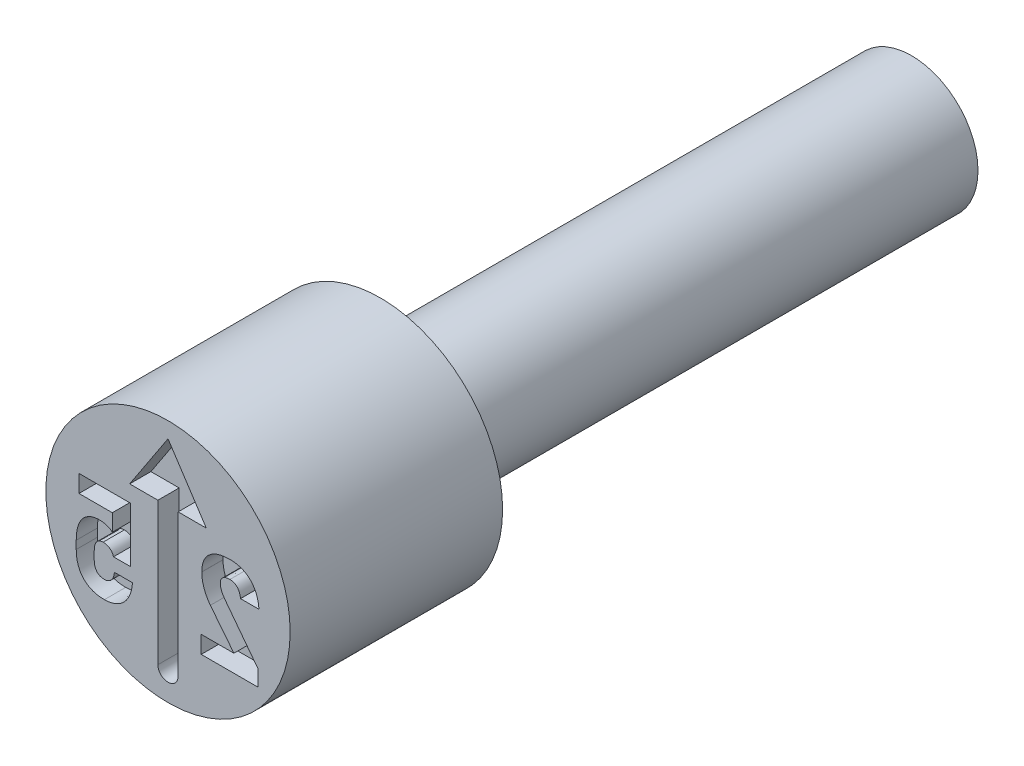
ISO-10303-21;
HEADER;
FILE_DESCRIPTION(('STEP AP214'),'2;1');
FILE_NAME('part.step','',(''),(''),'','','');
FILE_SCHEMA(('AUTOMOTIVE_DESIGN { 1 0 10303 214 1 1 1 1 }'));
ENDSEC;
DATA;
#1=APPLICATION_CONTEXT('core data for automotive mechanical design processes');
#2=APPLICATION_PROTOCOL_DEFINITION('international standard','automotive_design',2000,#1);
#3=PRODUCT_CONTEXT('',#1,'mechanical');
#4=PRODUCT('Part','Part','',(#3));
#5=PRODUCT_RELATED_PRODUCT_CATEGORY('part','',(#4));
#6=PRODUCT_DEFINITION_FORMATION('','',#4);
#7=PRODUCT_DEFINITION_CONTEXT('part definition',#1,'design');
#8=PRODUCT_DEFINITION('design','',#6,#7);
#9=PRODUCT_DEFINITION_SHAPE('','',#8);
#10=(LENGTH_UNIT() NAMED_UNIT(*) SI_UNIT(.MILLI.,.METRE.));
#11=(NAMED_UNIT(*) PLANE_ANGLE_UNIT() SI_UNIT($,.RADIAN.));
#12=(NAMED_UNIT(*) SI_UNIT($,.STERADIAN.) SOLID_ANGLE_UNIT());
#13=UNCERTAINTY_MEASURE_WITH_UNIT(LENGTH_MEASURE(1.E-05),#10,'distance_accuracy_value','');
#14=(GEOMETRIC_REPRESENTATION_CONTEXT(3) GLOBAL_UNCERTAINTY_ASSIGNED_CONTEXT((#13)) GLOBAL_UNIT_ASSIGNED_CONTEXT((#10,
#11,#12)) REPRESENTATION_CONTEXT('',''));
#15=CARTESIAN_POINT('',(0.,0.,0.));
#16=DIRECTION('',(0.,0.,1.));
#17=DIRECTION('',(1.,0.,0.));
#18=AXIS2_PLACEMENT_3D('',#15,#16,#17);
#19=CARTESIAN_POINT('',(0.,1.25,-4.));
#20=DIRECTION('',(0.,0.,1.));
#21=DIRECTION('',(1.,0.,0.));
#22=AXIS2_PLACEMENT_3D('',#19,#20,#21);
#23=PLANE('',#22);
#24=CARTESIAN_POINT('',(0.,0.,-4.));
#25=DIRECTION('',(0.,0.,1.));
#26=DIRECTION('',(1.,0.,0.));
#27=AXIS2_PLACEMENT_3D('',#24,#25,#26);
#28=CIRCLE('',#27,2.3);
#29=CARTESIAN_POINT('',(2.3,0.,-4.));
#30=VERTEX_POINT('',#29);
#31=EDGE_CURVE('E11',#30,#30,#28,.T.);
#32=ORIENTED_EDGE('',*,*,#31,.F.);
#33=EDGE_LOOP('',(#32));
#34=FACE_BOUND('',#33,.T.);
#35=CARTESIAN_POINT('',(0.,0.,-4.));
#36=DIRECTION('',(0.,0.,1.));
#37=DIRECTION('',(1.,0.,0.));
#38=AXIS2_PLACEMENT_3D('',#35,#36,#37);
#39=CIRCLE('',#38,1.25);
#40=CARTESIAN_POINT('',(1.25,0.,-4.));
#41=VERTEX_POINT('',#40);
#42=EDGE_CURVE('E572',#41,#41,#39,.T.);
#43=ORIENTED_EDGE('',*,*,#42,.T.);
#44=EDGE_LOOP('',(#43));
#45=FACE_BOUND('',#44,.T.);
#46=ADVANCED_FACE('F35',(#34,#45),#23,.F.);
#47=CARTESIAN_POINT('',(0.,0.,-0.403888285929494));
#48=DIRECTION('',(0.,0.,1.));
#49=DIRECTION('',(1.,0.,0.));
#50=AXIS2_PLACEMENT_3D('',#47,#48,#49);
#51=CYLINDRICAL_SURFACE('',#50,2.3);
#52=CARTESIAN_POINT('',(0.,0.,0.));
#53=DIRECTION('',(0.,0.,1.));
#54=DIRECTION('',(1.,0.,0.));
#55=AXIS2_PLACEMENT_3D('',#52,#53,#54);
#56=CIRCLE('',#55,2.3);
#57=CARTESIAN_POINT('',(2.3,0.,0.));
#58=VERTEX_POINT('',#57);
#59=EDGE_CURVE('E42',#58,#58,#56,.T.);
#60=ORIENTED_EDGE('',*,*,#59,.F.);
#61=EDGE_LOOP('',(#60));
#62=FACE_BOUND('',#61,.T.);
#63=ORIENTED_EDGE('',*,*,#31,.T.);
#64=EDGE_LOOP('',(#63));
#65=FACE_BOUND('',#64,.T.);
#66=ADVANCED_FACE('F594',(#62,#65),#51,.T.);
#67=CARTESIAN_POINT('',(0.,2.3,0.));
#68=DIRECTION('',(0.,0.,-1.));
#69=DIRECTION('',(-1.,0.,0.));
#70=AXIS2_PLACEMENT_3D('',#67,#68,#69);
#71=PLANE('',#70);
#72=DIRECTION('',(-0.60539313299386,0.795926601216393,0.));
#73=VECTOR('',#72,1.);
#74=CARTESIAN_POINT('',(1.69028245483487,-0.89406969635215,0.));
#75=LINE('',#74,#73);
#76=CARTESIAN_POINT('',(1.69028245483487,-0.89406969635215,0.));
#77=VERTEX_POINT('',#76);
#78=CARTESIAN_POINT('',(1.07255268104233,-0.0819237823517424,0.));
#79=VERTEX_POINT('',#78);
#80=EDGE_CURVE('E1034',#77,#79,#75,.T.);
#81=ORIENTED_EDGE('',*,*,#80,.F.);
#82=DIRECTION('',(0.,1.,0.));
#83=VECTOR('',#82,1.);
#84=CARTESIAN_POINT('',(1.69028245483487,-1.2,0.));
#85=LINE('',#84,#83);
#86=CARTESIAN_POINT('',(1.69028245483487,-1.2,0.));
#87=VERTEX_POINT('',#86);
#88=EDGE_CURVE('E49',#87,#77,#85,.T.);
#89=ORIENTED_EDGE('',*,*,#88,.F.);
#90=DIRECTION('',(1.,0.,0.));
#91=VECTOR('',#90,1.);
#92=CARTESIAN_POINT('',(0.625762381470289,-1.2,0.));
#93=LINE('',#92,#91);
#94=CARTESIAN_POINT('',(0.625762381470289,-1.2,0.));
#95=VERTEX_POINT('',#94);
#96=EDGE_CURVE('E330',#95,#87,#93,.T.);
#97=ORIENTED_EDGE('',*,*,#96,.F.);
#98=DIRECTION('',(0.,-1.,0.));
#99=VECTOR('',#98,1.);
#100=CARTESIAN_POINT('',(0.625762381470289,-0.873160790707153,0.));
#101=LINE('',#100,#99);
#102=CARTESIAN_POINT('',(0.625762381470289,-0.873160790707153,0.));
#103=VERTEX_POINT('',#102);
#104=EDGE_CURVE('E333',#103,#95,#101,.T.);
#105=ORIENTED_EDGE('',*,*,#104,.F.);
#106=DIRECTION('',(-1.,0.,0.));
#107=VECTOR('',#106,1.);
#108=CARTESIAN_POINT('',(1.24092439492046,-0.873160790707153,0.));
#109=LINE('',#108,#107);
#110=CARTESIAN_POINT('',(1.24092439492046,-0.873160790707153,0.));
#111=VERTEX_POINT('',#110);
#112=EDGE_CURVE('E1102',#111,#103,#109,.T.);
#113=ORIENTED_EDGE('',*,*,#112,.F.);
#114=DIRECTION('',(0.620676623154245,-0.78406666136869,0.));
#115=VECTOR('',#114,1.);
#116=CARTESIAN_POINT('',(0.797802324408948,-0.313389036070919,0.));
#117=LINE('',#116,#115);
#118=CARTESIAN_POINT('',(0.797802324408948,-0.313389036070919,0.));
#119=VERTEX_POINT('',#118);
#120=EDGE_CURVE('E1096',#119,#111,#117,.T.);
#121=ORIENTED_EDGE('',*,*,#120,.F.);
#122=CARTESIAN_POINT('',(0.635666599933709,0.148074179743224,0.));
#123=CARTESIAN_POINT('',(0.636136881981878,0.127628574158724,0.));
#124=CARTESIAN_POINT('',(0.637078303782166,0.0867000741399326,0.));
#125=CARTESIAN_POINT('',(0.645474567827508,0.0255541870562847,0.));
#126=CARTESIAN_POINT('',(0.659203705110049,-0.0352384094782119,0.));
#127=CARTESIAN_POINT('',(0.677832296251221,-0.0954646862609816,0.));
#128=CARTESIAN_POINT('',(0.70109424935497,-0.154118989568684,0.));
#129=CARTESIAN_POINT('',(0.728855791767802,-0.210266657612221,0.));
#130=CARTESIAN_POINT('',(0.760551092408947,-0.263764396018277,0.));
#131=CARTESIAN_POINT('',(0.785386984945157,-0.296849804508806,0.));
#132=CARTESIAN_POINT('',(0.797802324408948,-0.313389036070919,0.));
#133=B_SPLINE_CURVE_WITH_KNOTS('',3,(#122,#123,#124,#125,#126,#127,#128,#129,#130,#131,#132),
.UNSPECIFIED.,.F.,.F.,(4,1,1,1,1,1,1,1,4),(0.,0.123148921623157,0.24652244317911,
0.371108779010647,0.498350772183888,0.625999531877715,0.750879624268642,0.875465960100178,1.),.UNSPECIFIED.);
#134=CARTESIAN_POINT('',(0.635666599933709,0.148074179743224,0.));
#135=VERTEX_POINT('',#134);
#136=EDGE_CURVE('E1091',#135,#119,#133,.T.);
#137=ORIENTED_EDGE('',*,*,#136,.F.);
#138=DIRECTION('',(0.,-1.,0.));
#139=VECTOR('',#138,1.);
#140=CARTESIAN_POINT('',(0.635666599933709,0.149541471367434,0.));
#141=LINE('',#140,#139);
#142=CARTESIAN_POINT('',(0.635666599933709,0.149541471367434,0.));
#143=VERTEX_POINT('',#142);
#144=EDGE_CURVE('E1085',#143,#135,#141,.T.);
#145=ORIENTED_EDGE('',*,*,#144,.F.);
#146=CARTESIAN_POINT('',(1.167926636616,0.618707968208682,0.));
#147=CARTESIAN_POINT('',(1.14087034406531,0.618142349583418,0.));
#148=CARTESIAN_POINT('',(1.08850454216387,0.617047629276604,0.));
#149=CARTESIAN_POINT('',(1.01310130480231,0.60674208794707,0.));
#150=CARTESIAN_POINT('',(0.943766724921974,0.589592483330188,0.));
#151=CARTESIAN_POINT('',(0.880674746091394,0.565497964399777,0.));
#152=CARTESIAN_POINT('',(0.824239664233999,0.53452504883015,0.));
#153=CARTESIAN_POINT('',(0.774200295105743,0.497760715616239,0.));
#154=CARTESIAN_POINT('',(0.731969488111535,0.453777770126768,0.));
#155=CARTESIAN_POINT('',(0.696841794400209,0.403812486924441,0.));
#156=CARTESIAN_POINT('',(0.669150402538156,0.348057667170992,0.));
#157=CARTESIAN_POINT('',(0.649758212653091,0.286561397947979,0.));
#158=CARTESIAN_POINT('',(0.637882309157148,0.219817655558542,0.));
#159=CARTESIAN_POINT('',(0.636419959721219,0.173435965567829,0.));
#160=CARTESIAN_POINT('',(0.635666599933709,0.149541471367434,0.));
#161=B_SPLINE_CURVE_WITH_KNOTS('',3,(#146,#147,#148,#149,#150,#151,#152,#153,#154,#155,#156,
#157,#158,#159,#160),.UNSPECIFIED.,.F.,.F.,(4,1,1,1,1,1,1,1,1,1,1,1,4),(0.,0.100715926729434,
0.194929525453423,0.2827284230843,0.366191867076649,0.44566981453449,0.521804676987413,
0.596515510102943,0.671682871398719,0.748455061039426,0.827368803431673,0.911065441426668,1.),.UNSPECIFIED.);
#162=CARTESIAN_POINT('',(1.167926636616,0.618707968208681,0.));
#163=VERTEX_POINT('',#162);
#164=EDGE_CURVE('E1077',#163,#143,#161,.T.);
#165=ORIENTED_EDGE('',*,*,#164,.F.);
#166=CARTESIAN_POINT('',(1.71265865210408,0.080211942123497,0.));
#167=CARTESIAN_POINT('',(1.71016699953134,0.107310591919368,0.));
#168=CARTESIAN_POINT('',(1.70531310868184,0.16010041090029,0.));
#169=CARTESIAN_POINT('',(1.68880850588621,0.236016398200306,0.));
#170=CARTESIAN_POINT('',(1.66442641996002,0.305870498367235,0.));
#171=CARTESIAN_POINT('',(1.63327491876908,0.369855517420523,0.));
#172=CARTESIAN_POINT('',(1.59507774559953,0.427163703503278,0.));
#173=CARTESIAN_POINT('',(1.5507576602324,0.477779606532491,0.));
#174=CARTESIAN_POINT('',(1.49982379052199,0.520720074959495,0.));
#175=CARTESIAN_POINT('',(1.4431583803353,0.556401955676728,0.));
#176=CARTESIAN_POINT('',(1.38100893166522,0.58432664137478,0.));
#177=CARTESIAN_POINT('',(1.31413550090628,0.604672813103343,0.));
#178=CARTESIAN_POINT('',(1.24243736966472,0.616402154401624,0.));
#179=CARTESIAN_POINT('',(1.19315786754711,0.617927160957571,0.));
#180=CARTESIAN_POINT('',(1.167926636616,0.618707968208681,0.));
#181=B_SPLINE_CURVE_WITH_KNOTS('',3,(#166,#167,#168,#169,#170,#171,#172,#173,#174,#175,#176,
#177,#178,#179,#180),.UNSPECIFIED.,.F.,.F.,(4,1,1,1,1,1,1,1,1,1,1,1,4),(0.,0.0953291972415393,
0.185707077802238,0.271513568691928,0.35413169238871,0.434493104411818,0.512233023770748,
0.58917600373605,0.667186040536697,0.746219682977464,0.827302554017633,0.911578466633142,1.),.UNSPECIFIED.);
#182=CARTESIAN_POINT('',(1.71265865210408,0.080211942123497,0.));
#183=VERTEX_POINT('',#182);
#184=EDGE_CURVE('E1072',#183,#163,#181,.T.);
#185=ORIENTED_EDGE('',*,*,#184,.F.);
#186=DIRECTION('',(0.,1.,0.));
#187=VECTOR('',#186,1.);
#188=CARTESIAN_POINT('',(1.71265865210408,0.0787446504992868,0.));
#189=LINE('',#188,#187);
#190=CARTESIAN_POINT('',(1.71265865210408,0.0787446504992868,0.));
#191=VERTEX_POINT('',#190);
#192=EDGE_CURVE('E1069',#191,#183,#189,.T.);
#193=ORIENTED_EDGE('',*,*,#192,.F.);
#194=DIRECTION('',(1.,0.,0.));
#195=VECTOR('',#194,1.);
#196=CARTESIAN_POINT('',(1.36491053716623,0.0787446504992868,0.));
#197=LINE('',#196,#195);
#198=CARTESIAN_POINT('',(1.36491053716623,0.0787446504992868,0.));
#199=VERTEX_POINT('',#198);
#200=EDGE_CURVE('E1066',#199,#191,#197,.T.);
#201=ORIENTED_EDGE('',*,*,#200,.F.);
#202=DIRECTION('',(0.,-1.,0.));
#203=VECTOR('',#202,1.);
#204=CARTESIAN_POINT('',(1.36491053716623,0.080211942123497,0.));
#205=LINE('',#204,#203);
#206=CARTESIAN_POINT('',(1.36491053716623,0.080211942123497,0.));
#207=VERTEX_POINT('',#206);
#208=EDGE_CURVE('E1060',#207,#199,#205,.T.);
#209=ORIENTED_EDGE('',*,*,#208,.F.);
#210=CARTESIAN_POINT('',(1.16535887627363,0.291868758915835,0.));
#211=CARTESIAN_POINT('',(1.17875484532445,0.291302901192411,0.));
#212=CARTESIAN_POINT('',(1.20475218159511,0.290204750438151,0.));
#213=CARTESIAN_POINT('',(1.24173358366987,0.279740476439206,0.));
#214=CARTESIAN_POINT('',(1.27458541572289,0.261975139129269,0.));
#215=CARTESIAN_POINT('',(1.30302399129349,0.237423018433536,0.));
#216=CARTESIAN_POINT('',(1.32688653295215,0.206536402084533,0.));
#217=CARTESIAN_POINT('',(1.34447500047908,0.169328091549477,0.));
#218=CARTESIAN_POINT('',(1.35863928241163,0.127039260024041,0.));
#219=CARTESIAN_POINT('',(1.36274973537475,0.0963466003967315,0.));
#220=CARTESIAN_POINT('',(1.36491053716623,0.080211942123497,0.));
#221=B_SPLINE_CURVE_WITH_KNOTS('',3,(#210,#211,#212,#213,#214,#215,#216,#217,#218,#219,#220),
.UNSPECIFIED.,.F.,.F.,(4,1,1,1,1,1,1,1,4),(0.,0.124212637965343,0.241057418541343,
0.353359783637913,0.468536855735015,0.587568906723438,0.713021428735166,0.849139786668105,1.),.UNSPECIFIED.);
#222=CARTESIAN_POINT('',(1.16535887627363,0.291868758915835,0.));
#223=VERTEX_POINT('',#222);
#224=EDGE_CURVE('E1052',#223,#207,#221,.T.);
#225=ORIENTED_EDGE('',*,*,#224,.F.);
#226=CARTESIAN_POINT('',(0.984882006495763,0.139637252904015,0.));
#227=CARTESIAN_POINT('',(0.985374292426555,0.151195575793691,0.));
#228=CARTESIAN_POINT('',(0.986312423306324,0.173221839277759,0.));
#229=CARTESIAN_POINT('',(0.995369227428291,0.204210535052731,0.));
#230=CARTESIAN_POINT('',(1.01034559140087,0.231007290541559,0.));
#231=CARTESIAN_POINT('',(1.03132341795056,0.253470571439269,0.));
#232=CARTESIAN_POINT('',(1.05800734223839,0.270734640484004,0.));
#233=CARTESIAN_POINT('',(1.089482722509,0.283345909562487,0.));
#234=CARTESIAN_POINT('',(1.12591682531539,0.290481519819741,0.));
#235=CARTESIAN_POINT('',(1.15175486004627,0.291390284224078,0.));
#236=CARTESIAN_POINT('',(1.16535887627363,0.291868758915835,0.));
#237=B_SPLINE_CURVE_WITH_KNOTS('',3,(#226,#227,#228,#229,#230,#231,#232,#233,#234,#235,#236),
.UNSPECIFIED.,.F.,.F.,(4,1,1,1,1,1,1,1,4),(0.,0.129170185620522,0.246154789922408,
0.35773418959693,0.470108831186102,0.586692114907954,0.710769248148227,0.847716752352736,1.),.UNSPECIFIED.);
#238=CARTESIAN_POINT('',(0.984882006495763,0.139637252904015,0.));
#239=VERTEX_POINT('',#238);
#240=EDGE_CURVE('E1047',#239,#223,#237,.T.);
#241=ORIENTED_EDGE('',*,*,#240,.F.);
#242=DIRECTION('',(0.,1.,0.));
#243=VECTOR('',#242,1.);
#244=CARTESIAN_POINT('',(0.984882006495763,0.137069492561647,0.));
#245=LINE('',#244,#243);
#246=CARTESIAN_POINT('',(0.984882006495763,0.137069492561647,0.));
#247=VERTEX_POINT('',#246);
#248=EDGE_CURVE('E1041',#247,#239,#245,.T.);
#249=ORIENTED_EDGE('',*,*,#248,.F.);
#250=CARTESIAN_POINT('',(1.07255268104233,-0.0819237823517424,0.));
#251=CARTESIAN_POINT('',(1.0595972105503,-0.0639492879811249,0.));
#252=CARTESIAN_POINT('',(1.03430543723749,-0.0288593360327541,0.));
#253=CARTESIAN_POINT('',(1.01167711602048,0.0195395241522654,0.));
#254=CARTESIAN_POINT('',(0.997302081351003,0.0574892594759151,0.));
#255=CARTESIAN_POINT('',(0.990656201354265,0.0850173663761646,0.));
#256=CARTESIAN_POINT('',(0.98573641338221,0.111340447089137,0.));
#257=CARTESIAN_POINT('',(0.985162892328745,0.128611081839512,0.));
#258=CARTESIAN_POINT('',(0.984882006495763,0.137069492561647,0.));
#259=B_SPLINE_CURVE_WITH_KNOTS('',3,(#250,#251,#252,#253,#254,#255,#256,#257,#258),
.UNSPECIFIED.,.F.,.F.,(4,1,1,1,1,1,4),(0.,0.27673722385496,0.540248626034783,0.66563356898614,
0.784034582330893,0.894229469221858,1.),.UNSPECIFIED.);
#260=EDGE_CURVE('E1036',#79,#247,#259,.T.);
#261=ORIENTED_EDGE('',*,*,#260,.F.);
#262=EDGE_LOOP('',(#81,#89,#97,#105,#113,#121,#137,#145,#165,#185,#193,#201,#209,#225,#241,#249,#261));
#263=FACE_BOUND('',#262,.T.);
#264=CARTESIAN_POINT('',(-1.19699531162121,-1.21870796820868,0.));
#265=CARTESIAN_POINT('',(-1.1733379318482,-1.21798621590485,0.));
#266=CARTESIAN_POINT('',(-1.12704450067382,-1.21657387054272,0.));
#267=CARTESIAN_POINT('',(-1.05956513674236,-1.20389490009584,0.));
#268=CARTESIAN_POINT('',(-0.995592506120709,-1.18425921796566,0.));
#269=CARTESIAN_POINT('',(-0.935602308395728,-1.1562475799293,0.));
#270=CARTESIAN_POINT('',(-0.880246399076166,-1.12065962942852,0.));
#271=CARTESIAN_POINT('',(-0.830748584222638,-1.07714169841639,0.));
#272=CARTESIAN_POINT('',(-0.786654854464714,-1.02683316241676,0.));
#273=CARTESIAN_POINT('',(-0.74884940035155,-0.969293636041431,0.));
#274=CARTESIAN_POINT('',(-0.717715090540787,-0.905138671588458,0.));
#275=CARTESIAN_POINT('',(-0.69347648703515,-0.835124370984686,0.));
#276=CARTESIAN_POINT('',(-0.676828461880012,-0.759376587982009,0.));
#277=CARTESIAN_POINT('',(-0.671988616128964,-0.70682411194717,0.));
#278=CARTESIAN_POINT('',(-0.669503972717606,-0.679845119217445,0.));
#279=B_SPLINE_CURVE_WITH_KNOTS('',3,(#264,#265,#266,#267,#268,#269,#270,#271,#272,#273,#274,
#275,#276,#277,#278),.UNSPECIFIED.,.F.,.F.,(4,1,1,1,1,1,1,1,1,1,1,1,4),(0.,0.0844304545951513,
0.165215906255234,0.244369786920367,0.322918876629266,0.400936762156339,0.47863123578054,
0.557558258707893,0.639203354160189,0.723781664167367,0.811629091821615,0.903295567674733,1.),.UNSPECIFIED.);
#280=CARTESIAN_POINT('',(-1.19699531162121,-1.21870796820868,0.));
#281=VERTEX_POINT('',#280);
#282=CARTESIAN_POINT('',(-0.669503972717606,-0.679845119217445,0.));
#283=VERTEX_POINT('',#282);
#284=EDGE_CURVE('E397',#281,#283,#279,.T.);
#285=ORIENTED_EDGE('',*,*,#284,.F.);
#286=CARTESIAN_POINT('',(-1.72778805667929,-0.666272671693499,0.));
#287=CARTESIAN_POINT('',(-1.72698450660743,-0.694307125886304,0.));
#288=CARTESIAN_POINT('',(-1.72543001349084,-0.74854066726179,0.));
#289=CARTESIAN_POINT('',(-1.71431375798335,-0.826966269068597,0.));
#290=CARTESIAN_POINT('',(-1.69427429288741,-0.898905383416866,0.));
#291=CARTESIAN_POINT('',(-1.66742436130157,-0.964823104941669,0.));
#292=CARTESIAN_POINT('',(-1.63236394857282,-1.02340953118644,0.));
#293=CARTESIAN_POINT('',(-1.5903811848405,-1.07515956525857,0.));
#294=CARTESIAN_POINT('',(-1.54070992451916,-1.11887835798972,0.));
#295=CARTESIAN_POINT('',(-1.48452244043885,-1.15567141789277,0.));
#296=CARTESIAN_POINT('',(-1.42128410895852,-1.1838891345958,0.));
#297=CARTESIAN_POINT('',(-1.35200548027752,-1.20438838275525,0.));
#298=CARTESIAN_POINT('',(-1.27641239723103,-1.21658143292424,0.));
#299=CARTESIAN_POINT('',(-1.22406390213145,-1.21798315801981,0.));
#300=CARTESIAN_POINT('',(-1.19699531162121,-1.21870796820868,0.));
#301=B_SPLINE_CURVE_WITH_KNOTS('',3,(#286,#287,#288,#289,#290,#291,#292,#293,#294,#295,#296,
#297,#298,#299,#300),.UNSPECIFIED.,.F.,.F.,(4,1,1,1,1,1,1,1,1,1,1,1,4),(0.,0.0965919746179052,
0.1868602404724,0.272108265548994,0.35332451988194,0.431359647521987,0.506505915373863,
0.582010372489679,0.6584354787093,0.737063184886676,0.819709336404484,0.906774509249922,1.),.UNSPECIFIED.);
#302=CARTESIAN_POINT('',(-1.72778805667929,-0.666272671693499,0.));
#303=VERTEX_POINT('',#302);
#304=EDGE_CURVE('E57',#303,#281,#301,.T.);
#305=ORIENTED_EDGE('',*,*,#304,.F.);
#306=DIRECTION('',(0.,-1.,0.));
#307=VECTOR('',#306,1.);
#308=CARTESIAN_POINT('',(-1.72778805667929,-0.515508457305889,0.));
#309=LINE('',#308,#307);
#310=CARTESIAN_POINT('',(-1.72778805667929,-0.515508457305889,0.));
#311=VERTEX_POINT('',#310);
#312=EDGE_CURVE('E483',#311,#303,#309,.T.);
#313=ORIENTED_EDGE('',*,*,#312,.F.);
#314=CARTESIAN_POINT('',(-1.28466598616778,0.0354595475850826,0.));
#315=CARTESIAN_POINT('',(-1.30722507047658,0.0347453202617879,0.));
#316=CARTESIAN_POINT('',(-1.35097800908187,0.0333600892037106,0.));
#317=CARTESIAN_POINT('',(-1.4140880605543,0.020899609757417,0.));
#318=CARTESIAN_POINT('',(-1.47224983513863,0.000936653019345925,0.));
#319=CARTESIAN_POINT('',(-1.52498340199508,-0.0278241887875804,0.));
#320=CARTESIAN_POINT('',(-1.57234841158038,-0.0638715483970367,0.));
#321=CARTESIAN_POINT('',(-1.61348849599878,-0.10791848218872,0.));
#322=CARTESIAN_POINT('',(-1.64866011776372,-0.159247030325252,0.));
#323=CARTESIAN_POINT('',(-1.6774450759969,-0.21789153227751,0.));
#324=CARTESIAN_POINT('',(-1.70010004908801,-0.283338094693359,0.));
#325=CARTESIAN_POINT('',(-1.71655503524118,-0.355129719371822,0.));
#326=CARTESIAN_POINT('',(-1.72593235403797,-0.433336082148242,0.));
#327=CARTESIAN_POINT('',(-1.72715513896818,-0.487482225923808,0.));
#328=CARTESIAN_POINT('',(-1.72778805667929,-0.515508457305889,0.));
#329=B_SPLINE_CURVE_WITH_KNOTS('',3,(#314,#315,#316,#317,#318,#319,#320,#321,#322,#323,#324,
#325,#326,#327,#328),.UNSPECIFIED.,.F.,.F.,(4,1,1,1,1,1,1,1,1,1,1,1,4),(0.,0.084394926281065,
0.163682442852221,0.239848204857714,0.3138063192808,0.387615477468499,0.461788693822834,
0.538496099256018,0.61978489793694,0.70565234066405,0.797279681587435,0.895071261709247,1.),.UNSPECIFIED.);
#330=CARTESIAN_POINT('',(-1.28466598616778,0.0354595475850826,0.));
#331=VERTEX_POINT('',#330);
#332=EDGE_CURVE('E475',#331,#311,#329,.T.);
#333=ORIENTED_EDGE('',*,*,#332,.F.);
#334=CARTESIAN_POINT('',(-1.04843203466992,-0.0448746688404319,0.));
#335=CARTESIAN_POINT('',(-1.05526124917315,-0.0388275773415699,0.));
#336=CARTESIAN_POINT('',(-1.06930947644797,-0.0263882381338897,0.));
#337=CARTESIAN_POINT('',(-1.09386981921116,-0.0105937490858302,0.));
#338=CARTESIAN_POINT('',(-1.12195931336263,0.00282108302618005,0.));
#339=CARTESIAN_POINT('',(-1.16340796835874,0.0182713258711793,0.));
#340=CARTESIAN_POINT('',(-1.21793188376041,0.0320103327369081,0.));
#341=CARTESIAN_POINT('',(-1.26269220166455,0.0343238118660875,0.));
#342=CARTESIAN_POINT('',(-1.28466598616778,0.0354595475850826,0.));
#343=B_SPLINE_CURVE_WITH_KNOTS('',3,(#334,#335,#336,#337,#338,#339,#340,#341,#342),
.UNSPECIFIED.,.F.,.F.,(4,1,1,1,1,1,4),(0.,0.107291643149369,0.220707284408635,0.342410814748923,
0.47317918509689,0.741372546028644,1.),.UNSPECIFIED.);
#344=CARTESIAN_POINT('',(-1.04843203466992,-0.0448746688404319,0.));
#345=VERTEX_POINT('',#344);
#346=EDGE_CURVE('E470',#345,#331,#343,.T.);
#347=ORIENTED_EDGE('',*,*,#346,.F.);
#348=DIRECTION('',(0.,-1.,0.));
#349=VECTOR('',#348,1.);
#350=CARTESIAN_POINT('',(-1.04843203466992,0.273160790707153,0.));
#351=LINE('',#350,#349);
#352=CARTESIAN_POINT('',(-1.04843203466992,0.273160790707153,0.));
#353=VERTEX_POINT('',#352);
#354=EDGE_CURVE('E467',#353,#345,#351,.T.);
#355=ORIENTED_EDGE('',*,*,#354,.F.);
#356=DIRECTION('',(1.,0.,0.));
#357=VECTOR('',#356,1.);
#358=CARTESIAN_POINT('',(-1.67606602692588,0.273160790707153,0.));
#359=LINE('',#358,#357);
#360=CARTESIAN_POINT('',(-1.67606602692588,0.273160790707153,0.));
#361=VERTEX_POINT('',#360);
#362=EDGE_CURVE('E464',#361,#353,#359,.T.);
#363=ORIENTED_EDGE('',*,*,#362,.F.);
#364=DIRECTION('',(0.,-1.,0.));
#365=VECTOR('',#364,1.);
#366=CARTESIAN_POINT('',(-1.67606602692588,0.6,0.));
#367=LINE('',#366,#365);
#368=CARTESIAN_POINT('',(-1.67606602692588,0.6,0.));
#369=VERTEX_POINT('',#368);
#370=EDGE_CURVE('E461',#369,#361,#367,.T.);
#371=ORIENTED_EDGE('',*,*,#370,.F.);
#372=DIRECTION('',(-1.,0.,0.));
#373=VECTOR('',#372,1.);
#374=CARTESIAN_POINT('',(-0.709120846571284,0.6,0.));
#375=LINE('',#374,#373);
#376=CARTESIAN_POINT('',(-0.709120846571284,0.6,0.));
#377=VERTEX_POINT('',#376);
#378=EDGE_CURVE('E458',#377,#369,#375,.T.);
#379=ORIENTED_EDGE('',*,*,#378,.F.);
#380=DIRECTION('',(0.,1.,0.));
#381=VECTOR('',#380,1.);
#382=CARTESIAN_POINT('',(-0.709120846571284,-0.434807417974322,0.));
#383=LINE('',#382,#381);
#384=CARTESIAN_POINT('',(-0.709120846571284,-0.434807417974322,0.));
#385=VERTEX_POINT('',#384);
#386=EDGE_CURVE('E455',#385,#377,#383,.T.);
#387=ORIENTED_EDGE('',*,*,#386,.F.);
#388=DIRECTION('',(1.,0.,0.));
#389=VECTOR('',#388,1.);
#390=CARTESIAN_POINT('',(-1.02605583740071,-0.434807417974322,0.));
#391=LINE('',#390,#389);
#392=CARTESIAN_POINT('',(-1.02605583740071,-0.434807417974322,0.));
#393=VERTEX_POINT('',#392);
#394=EDGE_CURVE('E449',#393,#385,#391,.T.);
#395=ORIENTED_EDGE('',*,*,#394,.F.);
#396=CARTESIAN_POINT('',(-1.22157244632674,-0.29358059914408,0.));
#397=CARTESIAN_POINT('',(-1.20979563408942,-0.293939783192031,0.));
#398=CARTESIAN_POINT('',(-1.18699616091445,-0.294635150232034,0.));
#399=CARTESIAN_POINT('',(-1.15416848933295,-0.301835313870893,0.));
#400=CARTESIAN_POINT('',(-1.12399661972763,-0.313615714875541,0.));
#401=CARTESIAN_POINT('',(-1.09682306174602,-0.330271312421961,0.));
#402=CARTESIAN_POINT('',(-1.07282288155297,-0.350684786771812,0.));
#403=CARTESIAN_POINT('',(-1.05306320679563,-0.375350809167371,0.));
#404=CARTESIAN_POINT('',(-1.03649895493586,-0.403222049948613,0.));
#405=CARTESIAN_POINT('',(-1.02958745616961,-0.424125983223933,0.));
#406=CARTESIAN_POINT('',(-1.02605583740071,-0.434807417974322,0.));
#407=B_SPLINE_CURVE_WITH_KNOTS('',3,(#396,#397,#398,#399,#400,#401,#402,#403,#404,#405,#406),
.UNSPECIFIED.,.F.,.F.,(4,1,1,1,1,1,1,1,4),(0.,0.135635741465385,0.262585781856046,
0.38539589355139,0.507524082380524,0.628507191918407,0.746772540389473,0.870606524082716,1.),.UNSPECIFIED.);
#408=CARTESIAN_POINT('',(-1.22157244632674,-0.29358059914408,0.));
#409=VERTEX_POINT('',#408);
#410=EDGE_CURVE('E441',#409,#393,#407,.T.);
#411=ORIENTED_EDGE('',*,*,#410,.F.);
#412=CARTESIAN_POINT('',(-1.38884369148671,-0.515508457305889,0.));
#413=CARTESIAN_POINT('',(-1.38848141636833,-0.498712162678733,0.));
#414=CARTESIAN_POINT('',(-1.38779387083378,-0.466835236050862,0.));
#415=CARTESIAN_POINT('',(-1.37924083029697,-0.422244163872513,0.));
#416=CARTESIAN_POINT('',(-1.36594254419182,-0.383339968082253,0.));
#417=CARTESIAN_POINT('',(-1.34630282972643,-0.351044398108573,0.));
#418=CARTESIAN_POINT('',(-1.32188864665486,-0.324976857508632,0.));
#419=CARTESIAN_POINT('',(-1.29234446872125,-0.306462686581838,0.));
#420=CARTESIAN_POINT('',(-1.258263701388,-0.295527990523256,0.));
#421=CARTESIAN_POINT('',(-1.23412674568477,-0.294246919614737,0.));
#422=CARTESIAN_POINT('',(-1.22157244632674,-0.29358059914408,0.));
#423=B_SPLINE_CURVE_WITH_KNOTS('',3,(#412,#413,#414,#415,#416,#417,#418,#419,#420,#421,#422),
.UNSPECIFIED.,.F.,.F.,(4,1,1,1,1,1,1,1,4),(0.,0.160198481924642,0.304033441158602,
0.431843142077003,0.550810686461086,0.662316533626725,0.76988812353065,0.880312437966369,1.),.UNSPECIFIED.);
#424=CARTESIAN_POINT('',(-1.38884369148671,-0.515508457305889,0.));
#425=VERTEX_POINT('',#424);
#426=EDGE_CURVE('E436',#425,#409,#423,.T.);
#427=ORIENTED_EDGE('',*,*,#426,.F.);
#428=DIRECTION('',(0.,1.,0.));
#429=VECTOR('',#428,1.);
#430=CARTESIAN_POINT('',(-1.38884369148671,-0.666272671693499,0.));
#431=LINE('',#430,#429);
#432=CARTESIAN_POINT('',(-1.38884369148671,-0.666272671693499,0.));
#433=VERTEX_POINT('',#432);
#434=EDGE_CURVE('E430',#433,#425,#431,.T.);
#435=ORIENTED_EDGE('',*,*,#434,.F.);
#436=CARTESIAN_POINT('',(-1.2017640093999,-0.889300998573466,0.));
#437=CARTESIAN_POINT('',(-1.21591139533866,-0.888684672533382,0.));
#438=CARTESIAN_POINT('',(-1.24297167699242,-0.887505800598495,0.));
#439=CARTESIAN_POINT('',(-1.28090114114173,-0.876127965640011,0.));
#440=CARTESIAN_POINT('',(-1.31392017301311,-0.857911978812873,0.));
#441=CARTESIAN_POINT('',(-1.3411939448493,-0.831700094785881,0.));
#442=CARTESIAN_POINT('',(-1.36295146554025,-0.799040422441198,0.));
#443=CARTESIAN_POINT('',(-1.37835268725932,-0.759930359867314,0.));
#444=CARTESIAN_POINT('',(-1.38747378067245,-0.714990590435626,0.));
#445=CARTESIAN_POINT('',(-1.38837136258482,-0.683070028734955,0.));
#446=CARTESIAN_POINT('',(-1.38884369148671,-0.666272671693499,0.));
#447=B_SPLINE_CURVE_WITH_KNOTS('',3,(#436,#437,#438,#439,#440,#441,#442,#443,#444,#445,#446),
.UNSPECIFIED.,.F.,.F.,(4,1,1,1,1,1,1,1,4),(0.,0.128261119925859,0.245330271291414,
0.356275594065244,0.467886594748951,0.585607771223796,0.710231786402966,0.847517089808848,1.),.UNSPECIFIED.);
#448=CARTESIAN_POINT('',(-1.2017640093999,-0.889300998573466,0.));
#449=VERTEX_POINT('',#448);
#450=EDGE_CURVE('E422',#449,#433,#447,.T.);
#451=ORIENTED_EDGE('',*,*,#450,.F.);
#452=CARTESIAN_POINT('',(-1.00881516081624,-0.679845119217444,0.));
#453=CARTESIAN_POINT('',(-1.0107521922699,-0.695599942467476,0.));
#454=CARTESIAN_POINT('',(-1.01444367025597,-0.725624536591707,0.));
#455=CARTESIAN_POINT('',(-1.02775516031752,-0.767290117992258,0.));
#456=CARTESIAN_POINT('',(-1.04513417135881,-0.803913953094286,0.));
#457=CARTESIAN_POINT('',(-1.06809047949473,-0.834644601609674,0.));
#458=CARTESIAN_POINT('',(-1.09535120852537,-0.859593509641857,0.));
#459=CARTESIAN_POINT('',(-1.12765426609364,-0.876514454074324,0.));
#460=CARTESIAN_POINT('',(-1.16335569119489,-0.887805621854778,0.));
#461=CARTESIAN_POINT('',(-1.18871189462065,-0.888792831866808,0.));
#462=CARTESIAN_POINT('',(-1.2017640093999,-0.889300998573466,0.));
#463=B_SPLINE_CURVE_WITH_KNOTS('',3,(#452,#453,#454,#455,#456,#457,#458,#459,#460,#461,#462),
.UNSPECIFIED.,.F.,.F.,(4,1,1,1,1,1,1,1,4),(0.,0.150277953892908,0.286390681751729,
0.412971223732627,0.533144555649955,0.648163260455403,0.760273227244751,0.876600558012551,1.),.UNSPECIFIED.);
#464=CARTESIAN_POINT('',(-1.00881516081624,-0.679845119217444,0.));
#465=VERTEX_POINT('',#464);
#466=EDGE_CURVE('E417',#465,#449,#463,.T.);
#467=ORIENTED_EDGE('',*,*,#466,.F.);
#468=DIRECTION('',(0.,-1.,0.));
#469=VECTOR('',#468,1.);
#470=CARTESIAN_POINT('',(-1.00881516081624,-0.678744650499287,0.));
#471=LINE('',#470,#469);
#472=CARTESIAN_POINT('',(-1.00881516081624,-0.678744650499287,0.));
#473=VERTEX_POINT('',#472);
#474=EDGE_CURVE('E414',#473,#465,#471,.T.);
#475=ORIENTED_EDGE('',*,*,#474,.F.);
#476=DIRECTION('',(-1.,0.,0.));
#477=VECTOR('',#476,1.);
#478=CARTESIAN_POINT('',(-0.669503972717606,-0.678744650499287,0.));
#479=LINE('',#478,#477);
#480=CARTESIAN_POINT('',(-0.669503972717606,-0.678744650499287,0.));
#481=VERTEX_POINT('',#480);
#482=EDGE_CURVE('E411',#481,#473,#479,.T.);
#483=ORIENTED_EDGE('',*,*,#482,.F.);
#484=DIRECTION('',(0.,1.,0.));
#485=VECTOR('',#484,1.);
#486=CARTESIAN_POINT('',(-0.669503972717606,-0.679845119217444,0.));
#487=LINE('',#486,#485);
#488=EDGE_CURVE('E405',#283,#481,#487,.T.);
#489=ORIENTED_EDGE('',*,*,#488,.F.);
#490=EDGE_LOOP('',(#285,#305,#313,#333,#347,#355,#363,#371,#379,#387,#395,#411,#427,#435,#451,
#467,#475,#483,#489));
#491=FACE_BOUND('',#490,.T.);
#492=DIRECTION('',(0.,1.,0.));
#493=VECTOR('',#492,1.);
#494=CARTESIAN_POINT('',(0.190473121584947,0.906351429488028,0.));
#495=LINE('',#494,#493);
#496=CARTESIAN_POINT('',(0.190473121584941,-1.77616183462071,0.));
#497=VERTEX_POINT('',#496);
#498=CARTESIAN_POINT('',(0.190473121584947,0.906351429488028,0.));
#499=VERTEX_POINT('',#498);
#500=EDGE_CURVE('E552',#497,#499,#495,.T.);
#501=ORIENTED_EDGE('',*,*,#500,.F.);
#502=CARTESIAN_POINT('',(1.6342449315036E-13,-1.77616183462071,0.));
#503=DIRECTION('',(0.,0.,1.));
#504=DIRECTION('',(1.,0.,0.));
#505=AXIS2_PLACEMENT_3D('',#502,#503,#504);
#506=CIRCLE('',#505,0.190473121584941);
#507=CARTESIAN_POINT('',(-0.190473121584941,-1.77616183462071,0.));
#508=VERTEX_POINT('',#507);
#509=EDGE_CURVE('E550',#508,#497,#506,.T.);
#510=ORIENTED_EDGE('',*,*,#509,.F.);
#511=DIRECTION('',(0.,-1.,0.));
#512=VECTOR('',#511,1.);
#513=CARTESIAN_POINT('',(-0.190473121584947,0.906351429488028,0.));
#514=LINE('',#513,#512);
#515=CARTESIAN_POINT('',(-0.190473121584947,0.906351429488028,0.));
#516=VERTEX_POINT('',#515);
#517=EDGE_CURVE('E531',#516,#508,#514,.T.);
#518=ORIENTED_EDGE('',*,*,#517,.F.);
#519=DIRECTION('',(1.,0.,0.));
#520=VECTOR('',#519,1.);
#521=CARTESIAN_POINT('',(-0.721917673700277,0.906351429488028,0.));
#522=LINE('',#521,#520);
#523=CARTESIAN_POINT('',(-0.721917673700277,0.906351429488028,0.));
#524=VERTEX_POINT('',#523);
#525=EDGE_CURVE('E565',#524,#516,#522,.T.);
#526=ORIENTED_EDGE('',*,*,#525,.F.);
#527=DIRECTION('',(-0.550159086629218,-0.835059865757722,0.));
#528=VECTOR('',#527,1.);
#529=CARTESIAN_POINT('',(0.,2.00211534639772,0.));
#530=LINE('',#529,#528);
#531=CARTESIAN_POINT('',(0.,2.00211534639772,0.));
#532=VERTEX_POINT('',#531);
#533=EDGE_CURVE('E562',#532,#524,#530,.T.);
#534=ORIENTED_EDGE('',*,*,#533,.F.);
#535=DIRECTION('',(-0.550159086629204,0.835059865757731,0.));
#536=VECTOR('',#535,1.);
#537=CARTESIAN_POINT('',(0.,2.00211534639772,0.));
#538=LINE('',#537,#536);
#539=CARTESIAN_POINT('',(0.721917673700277,0.906351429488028,0.));
#540=VERTEX_POINT('',#539);
#541=EDGE_CURVE('E559',#540,#532,#538,.T.);
#542=ORIENTED_EDGE('',*,*,#541,.F.);
#543=DIRECTION('',(1.,0.,0.));
#544=VECTOR('',#543,1.);
#545=CARTESIAN_POINT('',(0.721917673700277,0.906351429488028,0.));
#546=LINE('',#545,#544);
#547=EDGE_CURVE('E556',#499,#540,#546,.T.);
#548=ORIENTED_EDGE('',*,*,#547,.F.);
#549=EDGE_LOOP('',(#501,#510,#518,#526,#534,#542,#548));
#550=FACE_BOUND('',#549,.T.);
#551=ORIENTED_EDGE('',*,*,#59,.T.);
#552=EDGE_LOOP('',(#551));
#553=FACE_BOUND('',#552,.T.);
#554=ADVANCED_FACE('F592',(#263,#491,#550,#553),#71,.F.);
#555=CARTESIAN_POINT('',(0.,0.,-14.));
#556=DIRECTION('',(0.,0.,1.));
#557=DIRECTION('',(1.,0.,0.));
#558=AXIS2_PLACEMENT_3D('',#555,#556,#557);
#559=PLANE('',#558);
#560=CARTESIAN_POINT('',(0.,0.,-14.));
#561=DIRECTION('',(0.,0.,1.));
#562=DIRECTION('',(1.,0.,0.));
#563=AXIS2_PLACEMENT_3D('',#560,#561,#562);
#564=CIRCLE('',#563,1.25);
#565=CARTESIAN_POINT('',(1.25,0.,-14.));
#566=VERTEX_POINT('',#565);
#567=EDGE_CURVE('E587',#566,#566,#564,.T.);
#568=ORIENTED_EDGE('',*,*,#567,.F.);
#569=EDGE_LOOP('',(#568));
#570=FACE_BOUND('',#569,.T.);
#571=ADVANCED_FACE('F607',(#570),#559,.F.);
#572=CARTESIAN_POINT('',(0.,0.,-0.403888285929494));
#573=DIRECTION('',(0.,0.,1.));
#574=DIRECTION('',(1.,0.,0.));
#575=AXIS2_PLACEMENT_3D('',#572,#573,#574);
#576=CYLINDRICAL_SURFACE('',#575,1.25);
#577=ORIENTED_EDGE('',*,*,#42,.F.);
#578=EDGE_LOOP('',(#577));
#579=FACE_BOUND('',#578,.T.);
#580=ORIENTED_EDGE('',*,*,#567,.T.);
#581=EDGE_LOOP('',(#580));
#582=FACE_BOUND('',#581,.T.);
#583=ADVANCED_FACE('F603',(#579,#582),#576,.T.);
#584=CARTESIAN_POINT('',(1.6342449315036E-13,-1.77616183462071,-0.4));
#585=DIRECTION('',(0.,0.,1.));
#586=DIRECTION('',(1.,0.,0.));
#587=AXIS2_PLACEMENT_3D('',#584,#585,#586);
#588=CYLINDRICAL_SURFACE('',#587,0.190473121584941);
#589=ORIENTED_EDGE('',*,*,#509,.T.);
#590=DIRECTION('',(0.,0.,1.));
#591=VECTOR('',#590,1.);
#592=CARTESIAN_POINT('',(0.190473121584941,-1.77616183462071,-0.4));
#593=LINE('',#592,#591);
#594=CARTESIAN_POINT('',(0.190473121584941,-1.77616183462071,-0.4));
#595=VERTEX_POINT('',#594);
#596=EDGE_CURVE('E549',#595,#497,#593,.T.);
#597=ORIENTED_EDGE('',*,*,#596,.F.);
#598=CARTESIAN_POINT('',(1.6342449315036E-13,-1.77616183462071,-0.4));
#599=DIRECTION('',(0.,0.,1.));
#600=DIRECTION('',(1.,0.,0.));
#601=AXIS2_PLACEMENT_3D('',#598,#599,#600);
#602=CIRCLE('',#601,0.190473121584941);
#603=CARTESIAN_POINT('',(-0.190473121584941,-1.77616183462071,-0.4));
#604=VERTEX_POINT('',#603);
#605=EDGE_CURVE('E527',#604,#595,#602,.T.);
#606=ORIENTED_EDGE('',*,*,#605,.F.);
#607=DIRECTION('',(0.,0.,1.));
#608=VECTOR('',#607,1.);
#609=CARTESIAN_POINT('',(-0.190473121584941,-1.77616183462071,-0.4));
#610=LINE('',#609,#608);
#611=EDGE_CURVE('E570',#604,#508,#610,.T.);
#612=ORIENTED_EDGE('',*,*,#611,.T.);
#613=EDGE_LOOP('',(#589,#597,#606,#612));
#614=FACE_BOUND('',#613,.T.);
#615=ADVANCED_FACE('F606',(#614),#588,.F.);
#616=CARTESIAN_POINT('',(-0.190473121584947,0.906351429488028,-0.4));
#617=DIRECTION('',(-1.,0.,0.));
#618=DIRECTION('',(0.,-1.,0.));
#619=AXIS2_PLACEMENT_3D('',#616,#617,#618);
#620=PLANE('',#619);
#621=ORIENTED_EDGE('',*,*,#517,.T.);
#622=ORIENTED_EDGE('',*,*,#611,.F.);
#623=DIRECTION('',(0.,-1.,0.));
#624=VECTOR('',#623,1.);
#625=CARTESIAN_POINT('',(-0.190473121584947,0.906351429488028,-0.4));
#626=LINE('',#625,#624);
#627=CARTESIAN_POINT('',(-0.190473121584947,0.906351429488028,-0.4));
#628=VERTEX_POINT('',#627);
#629=EDGE_CURVE('E546',#628,#604,#626,.T.);
#630=ORIENTED_EDGE('',*,*,#629,.F.);
#631=DIRECTION('',(0.,0.,1.));
#632=VECTOR('',#631,1.);
#633=CARTESIAN_POINT('',(-0.190473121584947,0.906351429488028,-0.4));
#634=LINE('',#633,#632);
#635=EDGE_CURVE('E573',#628,#516,#634,.T.);
#636=ORIENTED_EDGE('',*,*,#635,.T.);
#637=EDGE_LOOP('',(#621,#622,#630,#636));
#638=FACE_BOUND('',#637,.T.);
#639=ADVANCED_FACE('F621',(#638),#620,.F.);
#640=CARTESIAN_POINT('',(-0.721917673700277,0.906351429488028,-0.4));
#641=DIRECTION('',(0.,-1.,0.));
#642=DIRECTION('',(0.,0.,-1.));
#643=AXIS2_PLACEMENT_3D('',#640,#641,#642);
#644=PLANE('',#643);
#645=ORIENTED_EDGE('',*,*,#525,.T.);
#646=ORIENTED_EDGE('',*,*,#635,.F.);
#647=DIRECTION('',(1.,0.,0.));
#648=VECTOR('',#647,1.);
#649=CARTESIAN_POINT('',(-0.721917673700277,0.906351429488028,-0.4));
#650=LINE('',#649,#648);
#651=CARTESIAN_POINT('',(-0.721917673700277,0.906351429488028,-0.4));
#652=VERTEX_POINT('',#651);
#653=EDGE_CURVE('E543',#652,#628,#650,.T.);
#654=ORIENTED_EDGE('',*,*,#653,.F.);
#655=DIRECTION('',(0.,0.,1.));
#656=VECTOR('',#655,1.);
#657=CARTESIAN_POINT('',(-0.721917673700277,0.906351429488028,-0.4));
#658=LINE('',#657,#656);
#659=EDGE_CURVE('E575',#652,#524,#658,.T.);
#660=ORIENTED_EDGE('',*,*,#659,.T.);
#661=EDGE_LOOP('',(#645,#646,#654,#660));
#662=FACE_BOUND('',#661,.T.);
#663=ADVANCED_FACE('F639',(#662),#644,.F.);
#664=CARTESIAN_POINT('',(0.,2.00211534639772,-0.4));
#665=DIRECTION('',(-0.835059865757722,0.550159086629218,0.));
#666=DIRECTION('',(-0.550159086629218,-0.835059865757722,0.));
#667=AXIS2_PLACEMENT_3D('',#664,#665,#666);
#668=PLANE('',#667);
#669=ORIENTED_EDGE('',*,*,#533,.T.);
#670=ORIENTED_EDGE('',*,*,#659,.F.);
#671=DIRECTION('',(-0.550159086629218,-0.835059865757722,0.));
#672=VECTOR('',#671,1.);
#673=CARTESIAN_POINT('',(0.,2.00211534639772,-0.4));
#674=LINE('',#673,#672);
#675=CARTESIAN_POINT('',(0.,2.00211534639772,-0.4));
#676=VERTEX_POINT('',#675);
#677=EDGE_CURVE('E540',#676,#652,#674,.T.);
#678=ORIENTED_EDGE('',*,*,#677,.F.);
#679=DIRECTION('',(0.,0.,1.));
#680=VECTOR('',#679,1.);
#681=CARTESIAN_POINT('',(0.,2.00211534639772,-0.4));
#682=LINE('',#681,#680);
#683=EDGE_CURVE('E577',#676,#532,#682,.T.);
#684=ORIENTED_EDGE('',*,*,#683,.T.);
#685=EDGE_LOOP('',(#669,#670,#678,#684));
#686=FACE_BOUND('',#685,.T.);
#687=ADVANCED_FACE('F635',(#686),#668,.F.);
#688=CARTESIAN_POINT('',(0.,2.00211534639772,-0.4));
#689=DIRECTION('',(0.835059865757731,0.550159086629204,0.));
#690=DIRECTION('',(-0.550159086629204,0.835059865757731,0.));
#691=AXIS2_PLACEMENT_3D('',#688,#689,#690);
#692=PLANE('',#691);
#693=ORIENTED_EDGE('',*,*,#541,.T.);
#694=ORIENTED_EDGE('',*,*,#683,.F.);
#695=DIRECTION('',(-0.550159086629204,0.835059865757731,0.));
#696=VECTOR('',#695,1.);
#697=CARTESIAN_POINT('',(0.,2.00211534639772,-0.4));
#698=LINE('',#697,#696);
#699=CARTESIAN_POINT('',(0.721917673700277,0.906351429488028,-0.4));
#700=VERTEX_POINT('',#699);
#701=EDGE_CURVE('E537',#700,#676,#698,.T.);
#702=ORIENTED_EDGE('',*,*,#701,.F.);
#703=DIRECTION('',(0.,0.,1.));
#704=VECTOR('',#703,1.);
#705=CARTESIAN_POINT('',(0.721917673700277,0.906351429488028,-0.4));
#706=LINE('',#705,#704);
#707=EDGE_CURVE('E579',#700,#540,#706,.T.);
#708=ORIENTED_EDGE('',*,*,#707,.T.);
#709=EDGE_LOOP('',(#693,#694,#702,#708));
#710=FACE_BOUND('',#709,.T.);
#711=ADVANCED_FACE('F631',(#710),#692,.F.);
#712=CARTESIAN_POINT('',(0.721917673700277,0.906351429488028,-0.4));
#713=DIRECTION('',(0.,-1.,0.));
#714=DIRECTION('',(0.,0.,-1.));
#715=AXIS2_PLACEMENT_3D('',#712,#713,#714);
#716=PLANE('',#715);
#717=ORIENTED_EDGE('',*,*,#547,.T.);
#718=ORIENTED_EDGE('',*,*,#707,.F.);
#719=DIRECTION('',(1.,0.,0.));
#720=VECTOR('',#719,1.);
#721=CARTESIAN_POINT('',(0.721917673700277,0.906351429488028,-0.4));
#722=LINE('',#721,#720);
#723=CARTESIAN_POINT('',(0.190473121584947,0.906351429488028,-0.4));
#724=VERTEX_POINT('',#723);
#725=EDGE_CURVE('E534',#724,#700,#722,.T.);
#726=ORIENTED_EDGE('',*,*,#725,.F.);
#727=DIRECTION('',(0.,0.,1.));
#728=VECTOR('',#727,1.);
#729=CARTESIAN_POINT('',(0.190473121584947,0.906351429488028,-0.4));
#730=LINE('',#729,#728);
#731=EDGE_CURVE('E581',#724,#499,#730,.T.);
#732=ORIENTED_EDGE('',*,*,#731,.T.);
#733=EDGE_LOOP('',(#717,#718,#726,#732));
#734=FACE_BOUND('',#733,.T.);
#735=ADVANCED_FACE('F627',(#734),#716,.F.);
#736=CARTESIAN_POINT('',(0.190473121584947,0.906351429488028,-0.4));
#737=DIRECTION('',(1.,0.,0.));
#738=DIRECTION('',(0.,1.,0.));
#739=AXIS2_PLACEMENT_3D('',#736,#737,#738);
#740=PLANE('',#739);
#741=ORIENTED_EDGE('',*,*,#500,.T.);
#742=ORIENTED_EDGE('',*,*,#731,.F.);
#743=DIRECTION('',(0.,1.,0.));
#744=VECTOR('',#743,1.);
#745=CARTESIAN_POINT('',(0.190473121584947,0.906351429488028,-0.4));
#746=LINE('',#745,#744);
#747=EDGE_CURVE('E530',#595,#724,#746,.T.);
#748=ORIENTED_EDGE('',*,*,#747,.F.);
#749=ORIENTED_EDGE('',*,*,#596,.T.);
#750=EDGE_LOOP('',(#741,#742,#748,#749));
#751=FACE_BOUND('',#750,.T.);
#752=ADVANCED_FACE('F623',(#751),#740,.F.);
#753=CARTESIAN_POINT('',(1.6342449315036E-13,-1.77616183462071,-0.4));
#754=DIRECTION('',(0.,0.,1.));
#755=DIRECTION('',(1.,0.,0.));
#756=AXIS2_PLACEMENT_3D('',#753,#754,#755);
#757=PLANE('',#756);
#758=ORIENTED_EDGE('',*,*,#605,.T.);
#759=ORIENTED_EDGE('',*,*,#747,.T.);
#760=ORIENTED_EDGE('',*,*,#725,.T.);
#761=ORIENTED_EDGE('',*,*,#701,.T.);
#762=ORIENTED_EDGE('',*,*,#677,.T.);
#763=ORIENTED_EDGE('',*,*,#653,.T.);
#764=ORIENTED_EDGE('',*,*,#629,.T.);
#765=EDGE_LOOP('',(#758,#759,#760,#761,#762,#763,#764));
#766=FACE_BOUND('',#765,.T.);
#767=ADVANCED_FACE('F626',(#766),#757,.T.);
#768=CARTESIAN_POINT('',(-1.72778805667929,-0.666272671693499,-0.4));
#769=CARTESIAN_POINT('',(-1.72698450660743,-0.694307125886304,-0.4));
#770=CARTESIAN_POINT('',(-1.72543001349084,-0.74854066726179,-0.4));
#771=CARTESIAN_POINT('',(-1.71431375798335,-0.826966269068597,-0.4));
#772=CARTESIAN_POINT('',(-1.69427429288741,-0.898905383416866,-0.4));
#773=CARTESIAN_POINT('',(-1.66742436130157,-0.964823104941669,-0.4));
#774=CARTESIAN_POINT('',(-1.63236394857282,-1.02340953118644,-0.4));
#775=CARTESIAN_POINT('',(-1.5903811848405,-1.07515956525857,-0.4));
#776=CARTESIAN_POINT('',(-1.54070992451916,-1.11887835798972,-0.4));
#777=CARTESIAN_POINT('',(-1.48452244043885,-1.15567141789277,-0.4));
#778=CARTESIAN_POINT('',(-1.42128410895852,-1.1838891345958,-0.4));
#779=CARTESIAN_POINT('',(-1.35200548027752,-1.20438838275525,-0.4));
#780=CARTESIAN_POINT('',(-1.27641239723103,-1.21658143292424,-0.4));
#781=CARTESIAN_POINT('',(-1.22406390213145,-1.21798315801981,-0.4));
#782=CARTESIAN_POINT('',(-1.19699531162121,-1.21870796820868,-0.4));
#783=B_SPLINE_CURVE_WITH_KNOTS('',3,(#768,#769,#770,#771,#772,#773,#774,#775,#776,#777,#778,
#779,#780,#781,#782),.UNSPECIFIED.,.F.,.F.,(4,1,1,1,1,1,1,1,1,1,1,1,4),(0.,0.0965919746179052,
0.1868602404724,0.272108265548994,0.35332451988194,0.431359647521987,0.506505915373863,
0.582010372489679,0.6584354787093,0.737063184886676,0.819709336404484,0.906774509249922,1.),.UNSPECIFIED.);
#784=DIRECTION('',(0.,0.,1.));
#785=VECTOR('',#784,1.);
#786=SURFACE_OF_LINEAR_EXTRUSION('',#783,#785);
#787=ORIENTED_EDGE('',*,*,#304,.T.);
#788=DIRECTION('',(0.,0.,1.));
#789=VECTOR('',#788,1.);
#790=CARTESIAN_POINT('',(-1.19699531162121,-1.21870796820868,-0.4));
#791=LINE('',#790,#789);
#792=CARTESIAN_POINT('',(-1.19699531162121,-1.21870796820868,-0.4));
#793=VERTEX_POINT('',#792);
#794=EDGE_CURVE('E393',#793,#281,#791,.T.);
#795=ORIENTED_EDGE('',*,*,#794,.F.);
#796=CARTESIAN_POINT('',(-1.72778805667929,-0.666272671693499,-0.4));
#797=VERTEX_POINT('',#796);
#798=EDGE_CURVE('E489',#797,#793,#783,.T.);
#799=ORIENTED_EDGE('',*,*,#798,.F.);
#800=DIRECTION('',(0.,0.,1.));
#801=VECTOR('',#800,1.);
#802=CARTESIAN_POINT('',(-1.72778805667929,-0.666272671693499,-0.4));
#803=LINE('',#802,#801);
#804=EDGE_CURVE('E490',#797,#303,#803,.T.);
#805=ORIENTED_EDGE('',*,*,#804,.T.);
#806=EDGE_LOOP('',(#787,#795,#799,#805));
#807=FACE_BOUND('',#806,.T.);
#808=ADVANCED_FACE('F367',(#807),#786,.F.);
#809=CARTESIAN_POINT('',(-1.72778805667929,-0.515508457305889,-0.4));
#810=DIRECTION('',(-1.,0.,0.));
#811=DIRECTION('',(0.,0.,1.));
#812=AXIS2_PLACEMENT_3D('',#809,#810,#811);
#813=PLANE('',#812);
#814=ORIENTED_EDGE('',*,*,#312,.T.);
#815=ORIENTED_EDGE('',*,*,#804,.F.);
#816=DIRECTION('',(0.,-1.,0.));
#817=VECTOR('',#816,1.);
#818=CARTESIAN_POINT('',(-1.72778805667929,-0.515508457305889,-0.4));
#819=LINE('',#818,#817);
#820=CARTESIAN_POINT('',(-1.72778805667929,-0.515508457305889,-0.4));
#821=VERTEX_POINT('',#820);
#822=EDGE_CURVE('E382',#821,#797,#819,.T.);
#823=ORIENTED_EDGE('',*,*,#822,.F.);
#824=DIRECTION('',(0.,0.,1.));
#825=VECTOR('',#824,1.);
#826=CARTESIAN_POINT('',(-1.72778805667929,-0.515508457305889,-0.4));
#827=LINE('',#826,#825);
#828=EDGE_CURVE('E492',#821,#311,#827,.T.);
#829=ORIENTED_EDGE('',*,*,#828,.T.);
#830=EDGE_LOOP('',(#814,#815,#823,#829));
#831=FACE_BOUND('',#830,.T.);
#832=ADVANCED_FACE('F363',(#831),#813,.F.);
#833=CARTESIAN_POINT('',(-1.28466598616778,0.0354595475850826,-0.4));
#834=CARTESIAN_POINT('',(-1.30722507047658,0.0347453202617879,-0.4));
#835=CARTESIAN_POINT('',(-1.35097800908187,0.0333600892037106,-0.4));
#836=CARTESIAN_POINT('',(-1.4140880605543,0.020899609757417,-0.4));
#837=CARTESIAN_POINT('',(-1.47224983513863,0.000936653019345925,-0.4));
#838=CARTESIAN_POINT('',(-1.52498340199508,-0.0278241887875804,-0.4));
#839=CARTESIAN_POINT('',(-1.57234841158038,-0.0638715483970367,-0.4));
#840=CARTESIAN_POINT('',(-1.61348849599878,-0.10791848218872,-0.4));
#841=CARTESIAN_POINT('',(-1.64866011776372,-0.159247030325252,-0.4));
#842=CARTESIAN_POINT('',(-1.6774450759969,-0.21789153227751,-0.4));
#843=CARTESIAN_POINT('',(-1.70010004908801,-0.283338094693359,-0.4));
#844=CARTESIAN_POINT('',(-1.71655503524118,-0.355129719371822,-0.4));
#845=CARTESIAN_POINT('',(-1.72593235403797,-0.433336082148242,-0.4));
#846=CARTESIAN_POINT('',(-1.72715513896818,-0.487482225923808,-0.4));
#847=CARTESIAN_POINT('',(-1.72778805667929,-0.515508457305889,-0.4));
#848=B_SPLINE_CURVE_WITH_KNOTS('',3,(#833,#834,#835,#836,#837,#838,#839,#840,#841,#842,#843,
#844,#845,#846,#847),.UNSPECIFIED.,.F.,.F.,(4,1,1,1,1,1,1,1,1,1,1,1,4),(0.,0.084394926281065,
0.163682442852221,0.239848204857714,0.3138063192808,0.387615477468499,0.461788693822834,
0.538496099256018,0.61978489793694,0.70565234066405,0.797279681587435,0.895071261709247,1.),.UNSPECIFIED.);
#849=DIRECTION('',(0.,0.,1.));
#850=VECTOR('',#849,1.);
#851=SURFACE_OF_LINEAR_EXTRUSION('',#848,#850);
#852=ORIENTED_EDGE('',*,*,#332,.T.);
#853=ORIENTED_EDGE('',*,*,#828,.F.);
#854=CARTESIAN_POINT('',(-1.28466598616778,0.0354595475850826,-0.4));
#855=VERTEX_POINT('',#854);
#856=EDGE_CURVE('E376',#855,#821,#848,.T.);
#857=ORIENTED_EDGE('',*,*,#856,.F.);
#858=DIRECTION('',(0.,0.,1.));
#859=VECTOR('',#858,1.);
#860=CARTESIAN_POINT('',(-1.28466598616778,0.0354595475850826,-0.4));
#861=LINE('',#860,#859);
#862=EDGE_CURVE('E494',#855,#331,#861,.T.);
#863=ORIENTED_EDGE('',*,*,#862,.T.);
#864=EDGE_LOOP('',(#852,#853,#857,#863));
#865=FACE_BOUND('',#864,.T.);
#866=ADVANCED_FACE('F366',(#865),#851,.F.);
#867=CARTESIAN_POINT('',(-1.04843203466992,-0.0448746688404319,-0.4));
#868=CARTESIAN_POINT('',(-1.05526124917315,-0.0388275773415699,-0.4));
#869=CARTESIAN_POINT('',(-1.06930947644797,-0.0263882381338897,-0.4));
#870=CARTESIAN_POINT('',(-1.09386981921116,-0.0105937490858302,-0.4));
#871=CARTESIAN_POINT('',(-1.12195931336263,0.00282108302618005,-0.4));
#872=CARTESIAN_POINT('',(-1.16340796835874,0.0182713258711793,-0.4));
#873=CARTESIAN_POINT('',(-1.21793188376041,0.0320103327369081,-0.4));
#874=CARTESIAN_POINT('',(-1.26269220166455,0.0343238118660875,-0.4));
#875=CARTESIAN_POINT('',(-1.28466598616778,0.0354595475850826,-0.4));
#876=B_SPLINE_CURVE_WITH_KNOTS('',3,(#867,#868,#869,#870,#871,#872,#873,#874,#875),
.UNSPECIFIED.,.F.,.F.,(4,1,1,1,1,1,4),(0.,0.107291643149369,0.220707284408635,0.342410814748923,
0.47317918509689,0.741372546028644,1.),.UNSPECIFIED.);
#877=DIRECTION('',(0.,0.,1.));
#878=VECTOR('',#877,1.);
#879=SURFACE_OF_LINEAR_EXTRUSION('',#876,#878);
#880=ORIENTED_EDGE('',*,*,#346,.T.);
#881=ORIENTED_EDGE('',*,*,#862,.F.);
#882=CARTESIAN_POINT('',(-1.04843203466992,-0.0448746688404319,-0.4));
#883=VERTEX_POINT('',#882);
#884=EDGE_CURVE('E383',#883,#855,#876,.T.);
#885=ORIENTED_EDGE('',*,*,#884,.F.);
#886=DIRECTION('',(0.,0.,1.));
#887=VECTOR('',#886,1.);
#888=CARTESIAN_POINT('',(-1.04843203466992,-0.0448746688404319,-0.4));
#889=LINE('',#888,#887);
#890=EDGE_CURVE('E496',#883,#345,#889,.T.);
#891=ORIENTED_EDGE('',*,*,#890,.T.);
#892=EDGE_LOOP('',(#880,#881,#885,#891));
#893=FACE_BOUND('',#892,.T.);
#894=ADVANCED_FACE('F372',(#893),#879,.F.);
#895=CARTESIAN_POINT('',(-1.04843203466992,0.273160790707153,-0.4));
#896=DIRECTION('',(-1.,0.,0.));
#897=DIRECTION('',(0.,0.,1.));
#898=AXIS2_PLACEMENT_3D('',#895,#896,#897);
#899=PLANE('',#898);
#900=ORIENTED_EDGE('',*,*,#354,.T.);
#901=ORIENTED_EDGE('',*,*,#890,.F.);
#902=DIRECTION('',(0.,-1.,0.));
#903=VECTOR('',#902,1.);
#904=CARTESIAN_POINT('',(-1.04843203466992,0.273160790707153,-0.4));
#905=LINE('',#904,#903);
#906=CARTESIAN_POINT('',(-1.04843203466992,0.273160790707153,-0.4));
#907=VERTEX_POINT('',#906);
#908=EDGE_CURVE('E744',#907,#883,#905,.T.);
#909=ORIENTED_EDGE('',*,*,#908,.F.);
#910=DIRECTION('',(0.,0.,1.));
#911=VECTOR('',#910,1.);
#912=CARTESIAN_POINT('',(-1.04843203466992,0.273160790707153,-0.4));
#913=LINE('',#912,#911);
#914=EDGE_CURVE('E498',#907,#353,#913,.T.);
#915=ORIENTED_EDGE('',*,*,#914,.T.);
#916=EDGE_LOOP('',(#900,#901,#909,#915));
#917=FACE_BOUND('',#916,.T.);
#918=ADVANCED_FACE('F741',(#917),#899,.F.);
#919=CARTESIAN_POINT('',(-1.67606602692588,0.273160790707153,-0.4));
#920=DIRECTION('',(0.,-1.,0.));
#921=DIRECTION('',(0.,0.,-1.));
#922=AXIS2_PLACEMENT_3D('',#919,#920,#921);
#923=PLANE('',#922);
#924=ORIENTED_EDGE('',*,*,#362,.T.);
#925=ORIENTED_EDGE('',*,*,#914,.F.);
#926=DIRECTION('',(1.,0.,0.));
#927=VECTOR('',#926,1.);
#928=CARTESIAN_POINT('',(-1.67606602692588,0.273160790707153,-0.4));
#929=LINE('',#928,#927);
#930=CARTESIAN_POINT('',(-1.67606602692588,0.273160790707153,-0.4));
#931=VERTEX_POINT('',#930);
#932=EDGE_CURVE('E749',#931,#907,#929,.T.);
#933=ORIENTED_EDGE('',*,*,#932,.F.);
#934=DIRECTION('',(0.,0.,1.));
#935=VECTOR('',#934,1.);
#936=CARTESIAN_POINT('',(-1.67606602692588,0.273160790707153,-0.4));
#937=LINE('',#936,#935);
#938=EDGE_CURVE('E500',#931,#361,#937,.T.);
#939=ORIENTED_EDGE('',*,*,#938,.T.);
#940=EDGE_LOOP('',(#924,#925,#933,#939));
#941=FACE_BOUND('',#940,.T.);
#942=ADVANCED_FACE('F748',(#941),#923,.F.);
#943=CARTESIAN_POINT('',(-1.67606602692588,0.6,-0.4));
#944=DIRECTION('',(-1.,0.,0.));
#945=DIRECTION('',(0.,0.,1.));
#946=AXIS2_PLACEMENT_3D('',#943,#944,#945);
#947=PLANE('',#946);
#948=ORIENTED_EDGE('',*,*,#370,.T.);
#949=ORIENTED_EDGE('',*,*,#938,.F.);
#950=DIRECTION('',(0.,-1.,0.));
#951=VECTOR('',#950,1.);
#952=CARTESIAN_POINT('',(-1.67606602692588,0.6,-0.4));
#953=LINE('',#952,#951);
#954=CARTESIAN_POINT('',(-1.67606602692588,0.6,-0.4));
#955=VERTEX_POINT('',#954);
#956=EDGE_CURVE('E1387',#955,#931,#953,.T.);
#957=ORIENTED_EDGE('',*,*,#956,.F.);
#958=DIRECTION('',(0.,0.,1.));
#959=VECTOR('',#958,1.);
#960=CARTESIAN_POINT('',(-1.67606602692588,0.6,-0.4));
#961=LINE('',#960,#959);
#962=EDGE_CURVE('E502',#955,#369,#961,.T.);
#963=ORIENTED_EDGE('',*,*,#962,.T.);
#964=EDGE_LOOP('',(#948,#949,#957,#963));
#965=FACE_BOUND('',#964,.T.);
#966=ADVANCED_FACE('F753',(#965),#947,.F.);
#967=CARTESIAN_POINT('',(-0.709120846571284,0.6,-0.4));
#968=DIRECTION('',(0.,1.,0.));
#969=DIRECTION('',(0.,0.,1.));
#970=AXIS2_PLACEMENT_3D('',#967,#968,#969);
#971=PLANE('',#970);
#972=ORIENTED_EDGE('',*,*,#378,.T.);
#973=ORIENTED_EDGE('',*,*,#962,.F.);
#974=DIRECTION('',(-1.,0.,0.));
#975=VECTOR('',#974,1.);
#976=CARTESIAN_POINT('',(-0.709120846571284,0.6,-0.4));
#977=LINE('',#976,#975);
#978=CARTESIAN_POINT('',(-0.709120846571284,0.6,-0.4));
#979=VERTEX_POINT('',#978);
#980=EDGE_CURVE('E761',#979,#955,#977,.T.);
#981=ORIENTED_EDGE('',*,*,#980,.F.);
#982=DIRECTION('',(0.,0.,1.));
#983=VECTOR('',#982,1.);
#984=CARTESIAN_POINT('',(-0.709120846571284,0.6,-0.4));
#985=LINE('',#984,#983);
#986=EDGE_CURVE('E504',#979,#377,#985,.T.);
#987=ORIENTED_EDGE('',*,*,#986,.T.);
#988=EDGE_LOOP('',(#972,#973,#981,#987));
#989=FACE_BOUND('',#988,.T.);
#990=ADVANCED_FACE('F758',(#989),#971,.F.);
#991=CARTESIAN_POINT('',(-0.709120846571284,-0.434807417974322,-0.4));
#992=DIRECTION('',(1.,0.,0.));
#993=DIRECTION('',(0.,0.,-1.));
#994=AXIS2_PLACEMENT_3D('',#991,#992,#993);
#995=PLANE('',#994);
#996=ORIENTED_EDGE('',*,*,#386,.T.);
#997=ORIENTED_EDGE('',*,*,#986,.F.);
#998=DIRECTION('',(0.,1.,0.));
#999=VECTOR('',#998,1.);
#1000=CARTESIAN_POINT('',(-0.709120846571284,-0.434807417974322,-0.4));
#1001=LINE('',#1000,#999);
#1002=CARTESIAN_POINT('',(-0.709120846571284,-0.434807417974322,-0.4));
#1003=VERTEX_POINT('',#1002);
#1004=EDGE_CURVE('E766',#1003,#979,#1001,.T.);
#1005=ORIENTED_EDGE('',*,*,#1004,.F.);
#1006=DIRECTION('',(0.,0.,1.));
#1007=VECTOR('',#1006,1.);
#1008=CARTESIAN_POINT('',(-0.709120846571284,-0.434807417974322,-0.4));
#1009=LINE('',#1008,#1007);
#1010=EDGE_CURVE('E506',#1003,#385,#1009,.T.);
#1011=ORIENTED_EDGE('',*,*,#1010,.T.);
#1012=EDGE_LOOP('',(#996,#997,#1005,#1011));
#1013=FACE_BOUND('',#1012,.T.);
#1014=ADVANCED_FACE('F765',(#1013),#995,.F.);
#1015=CARTESIAN_POINT('',(-1.02605583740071,-0.434807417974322,-0.4));
#1016=DIRECTION('',(0.,-1.,0.));
#1017=DIRECTION('',(0.,0.,-1.));
#1018=AXIS2_PLACEMENT_3D('',#1015,#1016,#1017);
#1019=PLANE('',#1018);
#1020=ORIENTED_EDGE('',*,*,#394,.T.);
#1021=ORIENTED_EDGE('',*,*,#1010,.F.);
#1022=DIRECTION('',(1.,0.,0.));
#1023=VECTOR('',#1022,1.);
#1024=CARTESIAN_POINT('',(-1.02605583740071,-0.434807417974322,-0.4));
#1025=LINE('',#1024,#1023);
#1026=CARTESIAN_POINT('',(-1.02605583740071,-0.434807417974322,-0.4));
#1027=VERTEX_POINT('',#1026);
#1028=EDGE_CURVE('E1380',#1027,#1003,#1025,.T.);
#1029=ORIENTED_EDGE('',*,*,#1028,.F.);
#1030=DIRECTION('',(0.,0.,1.));
#1031=VECTOR('',#1030,1.);
#1032=CARTESIAN_POINT('',(-1.02605583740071,-0.434807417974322,-0.4));
#1033=LINE('',#1032,#1031);
#1034=EDGE_CURVE('E508',#1027,#393,#1033,.T.);
#1035=ORIENTED_EDGE('',*,*,#1034,.T.);
#1036=EDGE_LOOP('',(#1020,#1021,#1029,#1035));
#1037=FACE_BOUND('',#1036,.T.);
#1038=ADVANCED_FACE('F770',(#1037),#1019,.F.);
#1039=CARTESIAN_POINT('',(-1.22157244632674,-0.29358059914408,-0.4));
#1040=CARTESIAN_POINT('',(-1.20979563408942,-0.293939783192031,-0.4));
#1041=CARTESIAN_POINT('',(-1.18699616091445,-0.294635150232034,-0.4));
#1042=CARTESIAN_POINT('',(-1.15416848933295,-0.301835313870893,-0.4));
#1043=CARTESIAN_POINT('',(-1.12399661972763,-0.313615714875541,-0.4));
#1044=CARTESIAN_POINT('',(-1.09682306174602,-0.330271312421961,-0.4));
#1045=CARTESIAN_POINT('',(-1.07282288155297,-0.350684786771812,-0.4));
#1046=CARTESIAN_POINT('',(-1.05306320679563,-0.375350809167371,-0.4));
#1047=CARTESIAN_POINT('',(-1.03649895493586,-0.403222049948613,-0.4));
#1048=CARTESIAN_POINT('',(-1.02958745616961,-0.424125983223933,-0.4));
#1049=CARTESIAN_POINT('',(-1.02605583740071,-0.434807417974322,-0.4));
#1050=B_SPLINE_CURVE_WITH_KNOTS('',3,(#1039,#1040,#1041,#1042,#1043,#1044,#1045,#1046,#1047,
#1048,#1049),.UNSPECIFIED.,.F.,.F.,(4,1,1,1,1,1,1,1,4),(0.,0.135635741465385,0.262585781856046,
0.38539589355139,0.507524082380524,0.628507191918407,0.746772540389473,0.870606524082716,1.),.UNSPECIFIED.);
#1051=DIRECTION('',(0.,0.,1.));
#1052=VECTOR('',#1051,1.);
#1053=SURFACE_OF_LINEAR_EXTRUSION('',#1050,#1052);
#1054=ORIENTED_EDGE('',*,*,#410,.T.);
#1055=ORIENTED_EDGE('',*,*,#1034,.F.);
#1056=CARTESIAN_POINT('',(-1.22157244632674,-0.29358059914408,-0.4));
#1057=VERTEX_POINT('',#1056);
#1058=EDGE_CURVE('E778',#1057,#1027,#1050,.T.);
#1059=ORIENTED_EDGE('',*,*,#1058,.F.);
#1060=DIRECTION('',(0.,0.,1.));
#1061=VECTOR('',#1060,1.);
#1062=CARTESIAN_POINT('',(-1.22157244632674,-0.29358059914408,-0.4));
#1063=LINE('',#1062,#1061);
#1064=EDGE_CURVE('E510',#1057,#409,#1063,.T.);
#1065=ORIENTED_EDGE('',*,*,#1064,.T.);
#1066=EDGE_LOOP('',(#1054,#1055,#1059,#1065));
#1067=FACE_BOUND('',#1066,.T.);
#1068=ADVANCED_FACE('F775',(#1067),#1053,.F.);
#1069=CARTESIAN_POINT('',(-1.38884369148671,-0.515508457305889,-0.4));
#1070=CARTESIAN_POINT('',(-1.38848141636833,-0.498712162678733,-0.4));
#1071=CARTESIAN_POINT('',(-1.38779387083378,-0.466835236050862,-0.4));
#1072=CARTESIAN_POINT('',(-1.37924083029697,-0.422244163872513,-0.4));
#1073=CARTESIAN_POINT('',(-1.36594254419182,-0.383339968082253,-0.4));
#1074=CARTESIAN_POINT('',(-1.34630282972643,-0.351044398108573,-0.4));
#1075=CARTESIAN_POINT('',(-1.32188864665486,-0.324976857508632,-0.4));
#1076=CARTESIAN_POINT('',(-1.29234446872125,-0.306462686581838,-0.4));
#1077=CARTESIAN_POINT('',(-1.258263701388,-0.295527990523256,-0.4));
#1078=CARTESIAN_POINT('',(-1.23412674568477,-0.294246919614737,-0.4));
#1079=CARTESIAN_POINT('',(-1.22157244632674,-0.29358059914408,-0.4));
#1080=B_SPLINE_CURVE_WITH_KNOTS('',3,(#1069,#1070,#1071,#1072,#1073,#1074,#1075,#1076,#1077,
#1078,#1079),.UNSPECIFIED.,.F.,.F.,(4,1,1,1,1,1,1,1,4),(0.,0.160198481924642,0.304033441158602,
0.431843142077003,0.550810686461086,0.662316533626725,0.76988812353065,0.880312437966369,1.),.UNSPECIFIED.);
#1081=DIRECTION('',(0.,0.,1.));
#1082=VECTOR('',#1081,1.);
#1083=SURFACE_OF_LINEAR_EXTRUSION('',#1080,#1082);
#1084=ORIENTED_EDGE('',*,*,#426,.T.);
#1085=ORIENTED_EDGE('',*,*,#1064,.F.);
#1086=CARTESIAN_POINT('',(-1.38884369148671,-0.515508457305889,-0.4));
#1087=VERTEX_POINT('',#1086);
#1088=EDGE_CURVE('E783',#1087,#1057,#1080,.T.);
#1089=ORIENTED_EDGE('',*,*,#1088,.F.);
#1090=DIRECTION('',(0.,0.,1.));
#1091=VECTOR('',#1090,1.);
#1092=CARTESIAN_POINT('',(-1.38884369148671,-0.515508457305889,-0.4));
#1093=LINE('',#1092,#1091);
#1094=EDGE_CURVE('E512',#1087,#425,#1093,.T.);
#1095=ORIENTED_EDGE('',*,*,#1094,.T.);
#1096=EDGE_LOOP('',(#1084,#1085,#1089,#1095));
#1097=FACE_BOUND('',#1096,.T.);
#1098=ADVANCED_FACE('F782',(#1097),#1083,.F.);
#1099=CARTESIAN_POINT('',(-1.38884369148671,-0.666272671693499,-0.4));
#1100=DIRECTION('',(1.,0.,0.));
#1101=DIRECTION('',(0.,0.,-1.));
#1102=AXIS2_PLACEMENT_3D('',#1099,#1100,#1101);
#1103=PLANE('',#1102);
#1104=ORIENTED_EDGE('',*,*,#434,.T.);
#1105=ORIENTED_EDGE('',*,*,#1094,.F.);
#1106=DIRECTION('',(0.,1.,0.));
#1107=VECTOR('',#1106,1.);
#1108=CARTESIAN_POINT('',(-1.38884369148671,-0.666272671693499,-0.4));
#1109=LINE('',#1108,#1107);
#1110=CARTESIAN_POINT('',(-1.38884369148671,-0.666272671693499,-0.4));
#1111=VERTEX_POINT('',#1110);
#1112=EDGE_CURVE('E793',#1111,#1087,#1109,.T.);
#1113=ORIENTED_EDGE('',*,*,#1112,.F.);
#1114=DIRECTION('',(0.,0.,1.));
#1115=VECTOR('',#1114,1.);
#1116=CARTESIAN_POINT('',(-1.38884369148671,-0.666272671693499,-0.4));
#1117=LINE('',#1116,#1115);
#1118=EDGE_CURVE('E514',#1111,#433,#1117,.T.);
#1119=ORIENTED_EDGE('',*,*,#1118,.T.);
#1120=EDGE_LOOP('',(#1104,#1105,#1113,#1119));
#1121=FACE_BOUND('',#1120,.T.);
#1122=ADVANCED_FACE('F787',(#1121),#1103,.F.);
#1123=CARTESIAN_POINT('',(-1.2017640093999,-0.889300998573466,-0.4));
#1124=CARTESIAN_POINT('',(-1.21591139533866,-0.888684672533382,-0.4));
#1125=CARTESIAN_POINT('',(-1.24297167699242,-0.887505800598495,-0.4));
#1126=CARTESIAN_POINT('',(-1.28090114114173,-0.876127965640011,-0.4));
#1127=CARTESIAN_POINT('',(-1.31392017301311,-0.857911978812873,-0.4));
#1128=CARTESIAN_POINT('',(-1.3411939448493,-0.831700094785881,-0.4));
#1129=CARTESIAN_POINT('',(-1.36295146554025,-0.799040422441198,-0.4));
#1130=CARTESIAN_POINT('',(-1.37835268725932,-0.759930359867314,-0.4));
#1131=CARTESIAN_POINT('',(-1.38747378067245,-0.714990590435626,-0.4));
#1132=CARTESIAN_POINT('',(-1.38837136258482,-0.683070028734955,-0.4));
#1133=CARTESIAN_POINT('',(-1.38884369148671,-0.666272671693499,-0.4));
#1134=B_SPLINE_CURVE_WITH_KNOTS('',3,(#1123,#1124,#1125,#1126,#1127,#1128,#1129,#1130,#1131,
#1132,#1133),.UNSPECIFIED.,.F.,.F.,(4,1,1,1,1,1,1,1,4),(0.,0.128261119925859,0.245330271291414,
0.356275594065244,0.467886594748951,0.585607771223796,0.710231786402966,0.847517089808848,1.),.UNSPECIFIED.);
#1135=DIRECTION('',(0.,0.,1.));
#1136=VECTOR('',#1135,1.);
#1137=SURFACE_OF_LINEAR_EXTRUSION('',#1134,#1136);
#1138=ORIENTED_EDGE('',*,*,#450,.T.);
#1139=ORIENTED_EDGE('',*,*,#1118,.F.);
#1140=CARTESIAN_POINT('',(-1.2017640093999,-0.889300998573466,-0.4));
#1141=VERTEX_POINT('',#1140);
#1142=EDGE_CURVE('E687',#1141,#1111,#1134,.T.);
#1143=ORIENTED_EDGE('',*,*,#1142,.F.);
#1144=DIRECTION('',(0.,0.,1.));
#1145=VECTOR('',#1144,1.);
#1146=CARTESIAN_POINT('',(-1.2017640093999,-0.889300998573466,-0.4));
#1147=LINE('',#1146,#1145);
#1148=EDGE_CURVE('E516',#1141,#449,#1147,.T.);
#1149=ORIENTED_EDGE('',*,*,#1148,.T.);
#1150=EDGE_LOOP('',(#1138,#1139,#1143,#1149));
#1151=FACE_BOUND('',#1150,.T.);
#1152=ADVANCED_FACE('F701',(#1151),#1137,.F.);
#1153=CARTESIAN_POINT('',(-1.00881516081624,-0.679845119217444,-0.4));
#1154=CARTESIAN_POINT('',(-1.0107521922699,-0.695599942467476,-0.4));
#1155=CARTESIAN_POINT('',(-1.01444367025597,-0.725624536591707,-0.4));
#1156=CARTESIAN_POINT('',(-1.02775516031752,-0.767290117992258,-0.4));
#1157=CARTESIAN_POINT('',(-1.04513417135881,-0.803913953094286,-0.4));
#1158=CARTESIAN_POINT('',(-1.06809047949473,-0.834644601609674,-0.4));
#1159=CARTESIAN_POINT('',(-1.09535120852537,-0.859593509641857,-0.4));
#1160=CARTESIAN_POINT('',(-1.12765426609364,-0.876514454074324,-0.4));
#1161=CARTESIAN_POINT('',(-1.16335569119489,-0.887805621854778,-0.4));
#1162=CARTESIAN_POINT('',(-1.18871189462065,-0.888792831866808,-0.4));
#1163=CARTESIAN_POINT('',(-1.2017640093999,-0.889300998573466,-0.4));
#1164=B_SPLINE_CURVE_WITH_KNOTS('',3,(#1153,#1154,#1155,#1156,#1157,#1158,#1159,#1160,#1161,
#1162,#1163),.UNSPECIFIED.,.F.,.F.,(4,1,1,1,1,1,1,1,4),(0.,0.150277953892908,0.286390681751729,
0.412971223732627,0.533144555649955,0.648163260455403,0.760273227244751,0.876600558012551,1.),.UNSPECIFIED.);
#1165=DIRECTION('',(0.,0.,1.));
#1166=VECTOR('',#1165,1.);
#1167=SURFACE_OF_LINEAR_EXTRUSION('',#1164,#1166);
#1168=ORIENTED_EDGE('',*,*,#466,.T.);
#1169=ORIENTED_EDGE('',*,*,#1148,.F.);
#1170=CARTESIAN_POINT('',(-1.00881516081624,-0.679845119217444,-0.4));
#1171=VERTEX_POINT('',#1170);
#1172=EDGE_CURVE('E681',#1171,#1141,#1164,.T.);
#1173=ORIENTED_EDGE('',*,*,#1172,.F.);
#1174=DIRECTION('',(0.,0.,1.));
#1175=VECTOR('',#1174,1.);
#1176=CARTESIAN_POINT('',(-1.00881516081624,-0.679845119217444,-0.4));
#1177=LINE('',#1176,#1175);
#1178=EDGE_CURVE('E518',#1171,#465,#1177,.T.);
#1179=ORIENTED_EDGE('',*,*,#1178,.T.);
#1180=EDGE_LOOP('',(#1168,#1169,#1173,#1179));
#1181=FACE_BOUND('',#1180,.T.);
#1182=ADVANCED_FACE('F696',(#1181),#1167,.F.);
#1183=CARTESIAN_POINT('',(-1.00881516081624,-0.678744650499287,-0.4));
#1184=DIRECTION('',(-1.,0.,0.));
#1185=DIRECTION('',(0.,0.,1.));
#1186=AXIS2_PLACEMENT_3D('',#1183,#1184,#1185);
#1187=PLANE('',#1186);
#1188=ORIENTED_EDGE('',*,*,#474,.T.);
#1189=ORIENTED_EDGE('',*,*,#1178,.F.);
#1190=DIRECTION('',(0.,-1.,0.));
#1191=VECTOR('',#1190,1.);
#1192=CARTESIAN_POINT('',(-1.00881516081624,-0.678744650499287,-0.4));
#1193=LINE('',#1192,#1191);
#1194=CARTESIAN_POINT('',(-1.00881516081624,-0.678744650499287,-0.4));
#1195=VERTEX_POINT('',#1194);
#1196=EDGE_CURVE('E678',#1195,#1171,#1193,.T.);
#1197=ORIENTED_EDGE('',*,*,#1196,.F.);
#1198=DIRECTION('',(0.,0.,1.));
#1199=VECTOR('',#1198,1.);
#1200=CARTESIAN_POINT('',(-1.00881516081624,-0.678744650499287,-0.4));
#1201=LINE('',#1200,#1199);
#1202=EDGE_CURVE('E520',#1195,#473,#1201,.T.);
#1203=ORIENTED_EDGE('',*,*,#1202,.T.);
#1204=EDGE_LOOP('',(#1188,#1189,#1197,#1203));
#1205=FACE_BOUND('',#1204,.T.);
#1206=ADVANCED_FACE('F700',(#1205),#1187,.F.);
#1207=CARTESIAN_POINT('',(-0.669503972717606,-0.678744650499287,-0.4));
#1208=DIRECTION('',(0.,1.,0.));
#1209=DIRECTION('',(0.,0.,1.));
#1210=AXIS2_PLACEMENT_3D('',#1207,#1208,#1209);
#1211=PLANE('',#1210);
#1212=ORIENTED_EDGE('',*,*,#482,.T.);
#1213=ORIENTED_EDGE('',*,*,#1202,.F.);
#1214=DIRECTION('',(-1.,0.,0.));
#1215=VECTOR('',#1214,1.);
#1216=CARTESIAN_POINT('',(-0.669503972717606,-0.678744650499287,-0.4));
#1217=LINE('',#1216,#1215);
#1218=CARTESIAN_POINT('',(-0.669503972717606,-0.678744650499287,-0.4));
#1219=VERTEX_POINT('',#1218);
#1220=EDGE_CURVE('E675',#1219,#1195,#1217,.T.);
#1221=ORIENTED_EDGE('',*,*,#1220,.F.);
#1222=DIRECTION('',(0.,0.,1.));
#1223=VECTOR('',#1222,1.);
#1224=CARTESIAN_POINT('',(-0.669503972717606,-0.678744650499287,-0.4));
#1225=LINE('',#1224,#1223);
#1226=EDGE_CURVE('E522',#1219,#481,#1225,.T.);
#1227=ORIENTED_EDGE('',*,*,#1226,.T.);
#1228=EDGE_LOOP('',(#1212,#1213,#1221,#1227));
#1229=FACE_BOUND('',#1228,.T.);
#1230=ADVANCED_FACE('F706',(#1229),#1211,.F.);
#1231=CARTESIAN_POINT('',(-0.669503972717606,-0.679845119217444,-0.4));
#1232=DIRECTION('',(1.,0.,0.));
#1233=DIRECTION('',(0.,0.,-1.));
#1234=AXIS2_PLACEMENT_3D('',#1231,#1232,#1233);
#1235=PLANE('',#1234);
#1236=ORIENTED_EDGE('',*,*,#488,.T.);
#1237=ORIENTED_EDGE('',*,*,#1226,.F.);
#1238=DIRECTION('',(0.,1.,0.));
#1239=VECTOR('',#1238,1.);
#1240=CARTESIAN_POINT('',(-0.669503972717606,-0.679845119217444,-0.4));
#1241=LINE('',#1240,#1239);
#1242=CARTESIAN_POINT('',(-0.669503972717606,-0.679845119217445,-0.4));
#1243=VERTEX_POINT('',#1242);
#1244=EDGE_CURVE('E669',#1243,#1219,#1241,.T.);
#1245=ORIENTED_EDGE('',*,*,#1244,.F.);
#1246=DIRECTION('',(0.,0.,1.));
#1247=VECTOR('',#1246,1.);
#1248=CARTESIAN_POINT('',(-0.669503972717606,-0.679845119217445,-0.4));
#1249=LINE('',#1248,#1247);
#1250=EDGE_CURVE('E524',#1243,#283,#1249,.T.);
#1251=ORIENTED_EDGE('',*,*,#1250,.T.);
#1252=EDGE_LOOP('',(#1236,#1237,#1245,#1251));
#1253=FACE_BOUND('',#1252,.T.);
#1254=ADVANCED_FACE('F709',(#1253),#1235,.F.);
#1255=CARTESIAN_POINT('',(-1.19699531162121,-1.21870796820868,-0.4));
#1256=CARTESIAN_POINT('',(-1.1733379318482,-1.21798621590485,-0.4));
#1257=CARTESIAN_POINT('',(-1.12704450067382,-1.21657387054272,-0.4));
#1258=CARTESIAN_POINT('',(-1.05956513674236,-1.20389490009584,-0.4));
#1259=CARTESIAN_POINT('',(-0.995592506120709,-1.18425921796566,-0.4));
#1260=CARTESIAN_POINT('',(-0.935602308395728,-1.1562475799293,-0.4));
#1261=CARTESIAN_POINT('',(-0.880246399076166,-1.12065962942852,-0.4));
#1262=CARTESIAN_POINT('',(-0.830748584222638,-1.07714169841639,-0.4));
#1263=CARTESIAN_POINT('',(-0.786654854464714,-1.02683316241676,-0.4));
#1264=CARTESIAN_POINT('',(-0.74884940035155,-0.969293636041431,-0.4));
#1265=CARTESIAN_POINT('',(-0.717715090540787,-0.905138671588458,-0.4));
#1266=CARTESIAN_POINT('',(-0.69347648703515,-0.835124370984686,-0.4));
#1267=CARTESIAN_POINT('',(-0.676828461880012,-0.759376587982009,-0.4));
#1268=CARTESIAN_POINT('',(-0.671988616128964,-0.70682411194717,-0.4));
#1269=CARTESIAN_POINT('',(-0.669503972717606,-0.679845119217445,-0.4));
#1270=B_SPLINE_CURVE_WITH_KNOTS('',3,(#1255,#1256,#1257,#1258,#1259,#1260,#1261,#1262,#1263,
#1264,#1265,#1266,#1267,#1268,#1269),.UNSPECIFIED.,.F.,.F.,(4,1,1,1,1,1,1,1,1,1,1,1,4),(0.,
0.0844304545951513,0.165215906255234,0.244369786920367,0.322918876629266,0.400936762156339,
0.47863123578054,0.557558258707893,0.639203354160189,0.723781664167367,0.811629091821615,
0.903295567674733,1.),.UNSPECIFIED.);
#1271=DIRECTION('',(0.,0.,1.));
#1272=VECTOR('',#1271,1.);
#1273=SURFACE_OF_LINEAR_EXTRUSION('',#1270,#1272);
#1274=ORIENTED_EDGE('',*,*,#284,.T.);
#1275=ORIENTED_EDGE('',*,*,#1250,.F.);
#1276=EDGE_CURVE('E659',#793,#1243,#1270,.T.);
#1277=ORIENTED_EDGE('',*,*,#1276,.F.);
#1278=ORIENTED_EDGE('',*,*,#794,.T.);
#1279=EDGE_LOOP('',(#1274,#1275,#1277,#1278));
#1280=FACE_BOUND('',#1279,.T.);
#1281=ADVANCED_FACE('F361',(#1280),#1273,.F.);
#1282=CARTESIAN_POINT('',(-1.59302483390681,-1.0696966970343,-0.4));
#1283=DIRECTION('',(0.,0.,-1.));
#1284=DIRECTION('',(-1.,0.,0.));
#1285=AXIS2_PLACEMENT_3D('',#1282,#1283,#1284);
#1286=PLANE('',#1285);
#1287=ORIENTED_EDGE('',*,*,#798,.T.);
#1288=ORIENTED_EDGE('',*,*,#1276,.T.);
#1289=ORIENTED_EDGE('',*,*,#1244,.T.);
#1290=ORIENTED_EDGE('',*,*,#1220,.T.);
#1291=ORIENTED_EDGE('',*,*,#1196,.T.);
#1292=ORIENTED_EDGE('',*,*,#1172,.T.);
#1293=ORIENTED_EDGE('',*,*,#1142,.T.);
#1294=ORIENTED_EDGE('',*,*,#1112,.T.);
#1295=ORIENTED_EDGE('',*,*,#1088,.T.);
#1296=ORIENTED_EDGE('',*,*,#1058,.T.);
#1297=ORIENTED_EDGE('',*,*,#1028,.T.);
#1298=ORIENTED_EDGE('',*,*,#1004,.T.);
#1299=ORIENTED_EDGE('',*,*,#980,.T.);
#1300=ORIENTED_EDGE('',*,*,#956,.T.);
#1301=ORIENTED_EDGE('',*,*,#932,.T.);
#1302=ORIENTED_EDGE('',*,*,#908,.T.);
#1303=ORIENTED_EDGE('',*,*,#884,.T.);
#1304=ORIENTED_EDGE('',*,*,#856,.T.);
#1305=ORIENTED_EDGE('',*,*,#822,.T.);
#1306=EDGE_LOOP('',(#1287,#1288,#1289,#1290,#1291,#1292,#1293,#1294,#1295,#1296,#1297,#1298,
#1299,#1300,#1301,#1302,#1303,#1304,#1305));
#1307=FACE_BOUND('',#1306,.T.);
#1308=ADVANCED_FACE('F358',(#1307),#1286,.F.);
#1309=CARTESIAN_POINT('',(1.69028245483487,-1.2,-0.4));
#1310=DIRECTION('',(1.,0.,0.));
#1311=DIRECTION('',(0.,0.,-1.));
#1312=AXIS2_PLACEMENT_3D('',#1309,#1310,#1311);
#1313=PLANE('',#1312);
#1314=ORIENTED_EDGE('',*,*,#88,.T.);
#1315=DIRECTION('',(0.,0.,1.));
#1316=VECTOR('',#1315,1.);
#1317=CARTESIAN_POINT('',(1.69028245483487,-0.89406969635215,-0.4));
#1318=LINE('',#1317,#1316);
#1319=CARTESIAN_POINT('',(1.69028245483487,-0.89406969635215,-0.4));
#1320=VERTEX_POINT('',#1319);
#1321=EDGE_CURVE('E307',#1320,#77,#1318,.T.);
#1322=ORIENTED_EDGE('',*,*,#1321,.F.);
#1323=DIRECTION('',(0.,1.,0.));
#1324=VECTOR('',#1323,1.);
#1325=CARTESIAN_POINT('',(1.69028245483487,-1.2,-0.4));
#1326=LINE('',#1325,#1324);
#1327=CARTESIAN_POINT('',(1.69028245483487,-1.2,-0.4));
#1328=VERTEX_POINT('',#1327);
#1329=EDGE_CURVE('E311',#1328,#1320,#1326,.T.);
#1330=ORIENTED_EDGE('',*,*,#1329,.F.);
#1331=DIRECTION('',(0.,0.,1.));
#1332=VECTOR('',#1331,1.);
#1333=CARTESIAN_POINT('',(1.69028245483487,-1.2,-0.4));
#1334=LINE('',#1333,#1332);
#1335=EDGE_CURVE('E553',#1328,#87,#1334,.T.);
#1336=ORIENTED_EDGE('',*,*,#1335,.T.);
#1337=EDGE_LOOP('',(#1314,#1322,#1330,#1336));
#1338=FACE_BOUND('',#1337,.T.);
#1339=ADVANCED_FACE('F309',(#1338),#1313,.F.);
#1340=CARTESIAN_POINT('',(0.625762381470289,-1.2,-0.4));
#1341=DIRECTION('',(0.,-1.,0.));
#1342=DIRECTION('',(0.,0.,-1.));
#1343=AXIS2_PLACEMENT_3D('',#1340,#1341,#1342);
#1344=PLANE('',#1343);
#1345=ORIENTED_EDGE('',*,*,#96,.T.);
#1346=ORIENTED_EDGE('',*,*,#1335,.F.);
#1347=DIRECTION('',(1.,0.,0.));
#1348=VECTOR('',#1347,1.);
#1349=CARTESIAN_POINT('',(0.625762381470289,-1.2,-0.4));
#1350=LINE('',#1349,#1348);
#1351=CARTESIAN_POINT('',(0.625762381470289,-1.2,-0.4));
#1352=VERTEX_POINT('',#1351);
#1353=EDGE_CURVE('E317',#1352,#1328,#1350,.T.);
#1354=ORIENTED_EDGE('',*,*,#1353,.F.);
#1355=DIRECTION('',(0.,0.,1.));
#1356=VECTOR('',#1355,1.);
#1357=CARTESIAN_POINT('',(0.625762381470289,-1.2,-0.4));
#1358=LINE('',#1357,#1356);
#1359=EDGE_CURVE('E1108',#1352,#95,#1358,.T.);
#1360=ORIENTED_EDGE('',*,*,#1359,.T.);
#1361=EDGE_LOOP('',(#1345,#1346,#1354,#1360));
#1362=FACE_BOUND('',#1361,.T.);
#1363=ADVANCED_FACE('F357',(#1362),#1344,.F.);
#1364=CARTESIAN_POINT('',(0.625762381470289,-0.873160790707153,-0.4));
#1365=DIRECTION('',(-1.,0.,0.));
#1366=DIRECTION('',(0.,0.,1.));
#1367=AXIS2_PLACEMENT_3D('',#1364,#1365,#1366);
#1368=PLANE('',#1367);
#1369=ORIENTED_EDGE('',*,*,#104,.T.);
#1370=ORIENTED_EDGE('',*,*,#1359,.F.);
#1371=DIRECTION('',(0.,-1.,0.));
#1372=VECTOR('',#1371,1.);
#1373=CARTESIAN_POINT('',(0.625762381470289,-0.873160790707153,-0.4));
#1374=LINE('',#1373,#1372);
#1375=CARTESIAN_POINT('',(0.625762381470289,-0.873160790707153,-0.4));
#1376=VERTEX_POINT('',#1375);
#1377=EDGE_CURVE('E1030',#1376,#1352,#1374,.T.);
#1378=ORIENTED_EDGE('',*,*,#1377,.F.);
#1379=DIRECTION('',(0.,0.,1.));
#1380=VECTOR('',#1379,1.);
#1381=CARTESIAN_POINT('',(0.625762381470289,-0.873160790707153,-0.4));
#1382=LINE('',#1381,#1380);
#1383=EDGE_CURVE('E1110',#1376,#103,#1382,.T.);
#1384=ORIENTED_EDGE('',*,*,#1383,.T.);
#1385=EDGE_LOOP('',(#1369,#1370,#1378,#1384));
#1386=FACE_BOUND('',#1385,.T.);
#1387=ADVANCED_FACE('F860',(#1386),#1368,.F.);
#1388=CARTESIAN_POINT('',(1.24092439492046,-0.873160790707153,-0.4));
#1389=DIRECTION('',(0.,1.,0.));
#1390=DIRECTION('',(0.,0.,1.));
#1391=AXIS2_PLACEMENT_3D('',#1388,#1389,#1390);
#1392=PLANE('',#1391);
#1393=ORIENTED_EDGE('',*,*,#112,.T.);
#1394=ORIENTED_EDGE('',*,*,#1383,.F.);
#1395=DIRECTION('',(-1.,0.,0.));
#1396=VECTOR('',#1395,1.);
#1397=CARTESIAN_POINT('',(1.24092439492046,-0.873160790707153,-0.4));
#1398=LINE('',#1397,#1396);
#1399=CARTESIAN_POINT('',(1.24092439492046,-0.873160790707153,-0.4));
#1400=VERTEX_POINT('',#1399);
#1401=EDGE_CURVE('E1027',#1400,#1376,#1398,.T.);
#1402=ORIENTED_EDGE('',*,*,#1401,.F.);
#1403=DIRECTION('',(0.,0.,1.));
#1404=VECTOR('',#1403,1.);
#1405=CARTESIAN_POINT('',(1.24092439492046,-0.873160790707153,-0.4));
#1406=LINE('',#1405,#1404);
#1407=EDGE_CURVE('E1112',#1400,#111,#1406,.T.);
#1408=ORIENTED_EDGE('',*,*,#1407,.T.);
#1409=EDGE_LOOP('',(#1393,#1394,#1402,#1408));
#1410=FACE_BOUND('',#1409,.T.);
#1411=ADVANCED_FACE('F870',(#1410),#1392,.F.);
#1412=CARTESIAN_POINT('',(0.797802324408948,-0.313389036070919,-0.4));
#1413=DIRECTION('',(-0.78406666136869,-0.620676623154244,0.));
#1414=DIRECTION('',(0.620676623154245,-0.78406666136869,0.));
#1415=AXIS2_PLACEMENT_3D('',#1412,#1413,#1414);
#1416=PLANE('',#1415);
#1417=ORIENTED_EDGE('',*,*,#120,.T.);
#1418=ORIENTED_EDGE('',*,*,#1407,.F.);
#1419=DIRECTION('',(0.620676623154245,-0.78406666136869,0.));
#1420=VECTOR('',#1419,1.);
#1421=CARTESIAN_POINT('',(0.797802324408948,-0.313389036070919,-0.4));
#1422=LINE('',#1421,#1420);
#1423=CARTESIAN_POINT('',(0.797802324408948,-0.313389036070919,-0.4));
#1424=VERTEX_POINT('',#1423);
#1425=EDGE_CURVE('E1019',#1424,#1400,#1422,.T.);
#1426=ORIENTED_EDGE('',*,*,#1425,.F.);
#1427=DIRECTION('',(0.,0.,1.));
#1428=VECTOR('',#1427,1.);
#1429=CARTESIAN_POINT('',(0.797802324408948,-0.313389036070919,-0.4));
#1430=LINE('',#1429,#1428);
#1431=EDGE_CURVE('E1114',#1424,#119,#1430,.T.);
#1432=ORIENTED_EDGE('',*,*,#1431,.T.);
#1433=EDGE_LOOP('',(#1417,#1418,#1426,#1432));
#1434=FACE_BOUND('',#1433,.T.);
#1435=ADVANCED_FACE('F880',(#1434),#1416,.F.);
#1436=CARTESIAN_POINT('',(0.635666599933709,0.148074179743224,-0.4));
#1437=CARTESIAN_POINT('',(0.636136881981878,0.127628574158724,-0.4));
#1438=CARTESIAN_POINT('',(0.637078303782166,0.0867000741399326,-0.4));
#1439=CARTESIAN_POINT('',(0.645474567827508,0.0255541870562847,-0.4));
#1440=CARTESIAN_POINT('',(0.659203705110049,-0.0352384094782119,-0.4));
#1441=CARTESIAN_POINT('',(0.677832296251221,-0.0954646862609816,-0.4));
#1442=CARTESIAN_POINT('',(0.70109424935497,-0.154118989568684,-0.4));
#1443=CARTESIAN_POINT('',(0.728855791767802,-0.210266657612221,-0.4));
#1444=CARTESIAN_POINT('',(0.760551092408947,-0.263764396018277,-0.4));
#1445=CARTESIAN_POINT('',(0.785386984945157,-0.296849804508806,-0.4));
#1446=CARTESIAN_POINT('',(0.797802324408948,-0.313389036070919,-0.4));
#1447=B_SPLINE_CURVE_WITH_KNOTS('',3,(#1436,#1437,#1438,#1439,#1440,#1441,#1442,#1443,#1444,
#1445,#1446),.UNSPECIFIED.,.F.,.F.,(4,1,1,1,1,1,1,1,4),(0.,0.123148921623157,0.24652244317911,
0.371108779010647,0.498350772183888,0.625999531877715,0.750879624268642,0.875465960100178,1.),.UNSPECIFIED.);
#1448=DIRECTION('',(0.,0.,1.));
#1449=VECTOR('',#1448,1.);
#1450=SURFACE_OF_LINEAR_EXTRUSION('',#1447,#1449);
#1451=ORIENTED_EDGE('',*,*,#136,.T.);
#1452=ORIENTED_EDGE('',*,*,#1431,.F.);
#1453=CARTESIAN_POINT('',(0.635666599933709,0.148074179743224,-0.4));
#1454=VERTEX_POINT('',#1453);
#1455=EDGE_CURVE('E1012',#1454,#1424,#1447,.T.);
#1456=ORIENTED_EDGE('',*,*,#1455,.F.);
#1457=DIRECTION('',(0.,0.,1.));
#1458=VECTOR('',#1457,1.);
#1459=CARTESIAN_POINT('',(0.635666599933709,0.148074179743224,-0.4));
#1460=LINE('',#1459,#1458);
#1461=EDGE_CURVE('E1116',#1454,#135,#1460,.T.);
#1462=ORIENTED_EDGE('',*,*,#1461,.T.);
#1463=EDGE_LOOP('',(#1451,#1452,#1456,#1462));
#1464=FACE_BOUND('',#1463,.T.);
#1465=ADVANCED_FACE('F890',(#1464),#1450,.F.);
#1466=CARTESIAN_POINT('',(0.635666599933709,0.149541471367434,-0.4));
#1467=DIRECTION('',(-1.,0.,0.));
#1468=DIRECTION('',(0.,0.,1.));
#1469=AXIS2_PLACEMENT_3D('',#1466,#1467,#1468);
#1470=PLANE('',#1469);
#1471=ORIENTED_EDGE('',*,*,#144,.T.);
#1472=ORIENTED_EDGE('',*,*,#1461,.F.);
#1473=DIRECTION('',(0.,-1.,0.));
#1474=VECTOR('',#1473,1.);
#1475=CARTESIAN_POINT('',(0.635666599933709,0.149541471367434,-0.4));
#1476=LINE('',#1475,#1474);
#1477=CARTESIAN_POINT('',(0.635666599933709,0.149541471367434,-0.4));
#1478=VERTEX_POINT('',#1477);
#1479=EDGE_CURVE('E1020',#1478,#1454,#1476,.T.);
#1480=ORIENTED_EDGE('',*,*,#1479,.F.);
#1481=DIRECTION('',(0.,0.,1.));
#1482=VECTOR('',#1481,1.);
#1483=CARTESIAN_POINT('',(0.635666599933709,0.149541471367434,-0.4));
#1484=LINE('',#1483,#1482);
#1485=EDGE_CURVE('E1118',#1478,#143,#1484,.T.);
#1486=ORIENTED_EDGE('',*,*,#1485,.T.);
#1487=EDGE_LOOP('',(#1471,#1472,#1480,#1486));
#1488=FACE_BOUND('',#1487,.T.);
#1489=ADVANCED_FACE('F900',(#1488),#1470,.F.);
#1490=CARTESIAN_POINT('',(1.167926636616,0.618707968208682,-0.4));
#1491=CARTESIAN_POINT('',(1.14087034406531,0.618142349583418,-0.4));
#1492=CARTESIAN_POINT('',(1.08850454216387,0.617047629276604,-0.4));
#1493=CARTESIAN_POINT('',(1.01310130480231,0.60674208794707,-0.4));
#1494=CARTESIAN_POINT('',(0.943766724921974,0.589592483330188,-0.4));
#1495=CARTESIAN_POINT('',(0.880674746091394,0.565497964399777,-0.4));
#1496=CARTESIAN_POINT('',(0.824239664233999,0.53452504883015,-0.4));
#1497=CARTESIAN_POINT('',(0.774200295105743,0.497760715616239,-0.4));
#1498=CARTESIAN_POINT('',(0.731969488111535,0.453777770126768,-0.4));
#1499=CARTESIAN_POINT('',(0.696841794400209,0.403812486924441,-0.4));
#1500=CARTESIAN_POINT('',(0.669150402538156,0.348057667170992,-0.4));
#1501=CARTESIAN_POINT('',(0.649758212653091,0.286561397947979,-0.4));
#1502=CARTESIAN_POINT('',(0.637882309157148,0.219817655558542,-0.4));
#1503=CARTESIAN_POINT('',(0.636419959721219,0.173435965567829,-0.4));
#1504=CARTESIAN_POINT('',(0.635666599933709,0.149541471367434,-0.4));
#1505=B_SPLINE_CURVE_WITH_KNOTS('',3,(#1490,#1491,#1492,#1493,#1494,#1495,#1496,#1497,#1498,
#1499,#1500,#1501,#1502,#1503,#1504),.UNSPECIFIED.,.F.,.F.,(4,1,1,1,1,1,1,1,1,1,1,1,4),(0.,
0.100715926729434,0.194929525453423,0.2827284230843,0.366191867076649,0.44566981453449,
0.521804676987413,0.596515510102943,0.671682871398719,0.748455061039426,0.827368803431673,
0.911065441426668,1.),.UNSPECIFIED.);
#1506=DIRECTION('',(0.,0.,1.));
#1507=VECTOR('',#1506,1.);
#1508=SURFACE_OF_LINEAR_EXTRUSION('',#1505,#1507);
#1509=ORIENTED_EDGE('',*,*,#164,.T.);
#1510=ORIENTED_EDGE('',*,*,#1485,.F.);
#1511=CARTESIAN_POINT('',(1.167926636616,0.618707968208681,-0.4));
#1512=VERTEX_POINT('',#1511);
#1513=EDGE_CURVE('E1165',#1512,#1478,#1505,.T.);
#1514=ORIENTED_EDGE('',*,*,#1513,.F.);
#1515=DIRECTION('',(0.,0.,1.));
#1516=VECTOR('',#1515,1.);
#1517=CARTESIAN_POINT('',(1.167926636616,0.618707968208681,-0.4));
#1518=LINE('',#1517,#1516);
#1519=EDGE_CURVE('E1120',#1512,#163,#1518,.T.);
#1520=ORIENTED_EDGE('',*,*,#1519,.T.);
#1521=EDGE_LOOP('',(#1509,#1510,#1514,#1520));
#1522=FACE_BOUND('',#1521,.T.);
#1523=ADVANCED_FACE('F910',(#1522),#1508,.F.);
#1524=CARTESIAN_POINT('',(1.71265865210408,0.080211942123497,-0.4));
#1525=CARTESIAN_POINT('',(1.71016699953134,0.107310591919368,-0.4));
#1526=CARTESIAN_POINT('',(1.70531310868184,0.16010041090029,-0.4));
#1527=CARTESIAN_POINT('',(1.68880850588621,0.236016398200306,-0.4));
#1528=CARTESIAN_POINT('',(1.66442641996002,0.305870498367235,-0.4));
#1529=CARTESIAN_POINT('',(1.63327491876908,0.369855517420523,-0.4));
#1530=CARTESIAN_POINT('',(1.59507774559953,0.427163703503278,-0.4));
#1531=CARTESIAN_POINT('',(1.5507576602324,0.477779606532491,-0.4));
#1532=CARTESIAN_POINT('',(1.49982379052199,0.520720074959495,-0.4));
#1533=CARTESIAN_POINT('',(1.4431583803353,0.556401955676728,-0.4));
#1534=CARTESIAN_POINT('',(1.38100893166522,0.58432664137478,-0.4));
#1535=CARTESIAN_POINT('',(1.31413550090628,0.604672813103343,-0.4));
#1536=CARTESIAN_POINT('',(1.24243736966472,0.616402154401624,-0.4));
#1537=CARTESIAN_POINT('',(1.19315786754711,0.617927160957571,-0.4));
#1538=CARTESIAN_POINT('',(1.167926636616,0.618707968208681,-0.4));
#1539=B_SPLINE_CURVE_WITH_KNOTS('',3,(#1524,#1525,#1526,#1527,#1528,#1529,#1530,#1531,#1532,
#1533,#1534,#1535,#1536,#1537,#1538),.UNSPECIFIED.,.F.,.F.,(4,1,1,1,1,1,1,1,1,1,1,1,4),(0.,
0.0953291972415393,0.185707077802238,0.271513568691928,0.35413169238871,0.434493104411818,
0.512233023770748,0.58917600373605,0.667186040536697,0.746219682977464,0.827302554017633,
0.911578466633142,1.),.UNSPECIFIED.);
#1540=DIRECTION('',(0.,0.,1.));
#1541=VECTOR('',#1540,1.);
#1542=SURFACE_OF_LINEAR_EXTRUSION('',#1539,#1541);
#1543=ORIENTED_EDGE('',*,*,#184,.T.);
#1544=ORIENTED_EDGE('',*,*,#1519,.F.);
#1545=CARTESIAN_POINT('',(1.71265865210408,0.080211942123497,-0.4));
#1546=VERTEX_POINT('',#1545);
#1547=EDGE_CURVE('E1159',#1546,#1512,#1539,.T.);
#1548=ORIENTED_EDGE('',*,*,#1547,.F.);
#1549=DIRECTION('',(0.,0.,1.));
#1550=VECTOR('',#1549,1.);
#1551=CARTESIAN_POINT('',(1.71265865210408,0.080211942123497,-0.4));
#1552=LINE('',#1551,#1550);
#1553=EDGE_CURVE('E1122',#1546,#183,#1552,.T.);
#1554=ORIENTED_EDGE('',*,*,#1553,.T.);
#1555=EDGE_LOOP('',(#1543,#1544,#1548,#1554));
#1556=FACE_BOUND('',#1555,.T.);
#1557=ADVANCED_FACE('F920',(#1556),#1542,.F.);
#1558=CARTESIAN_POINT('',(1.71265865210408,0.0787446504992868,-0.4));
#1559=DIRECTION('',(1.,0.,0.));
#1560=DIRECTION('',(0.,0.,-1.));
#1561=AXIS2_PLACEMENT_3D('',#1558,#1559,#1560);
#1562=PLANE('',#1561);
#1563=ORIENTED_EDGE('',*,*,#192,.T.);
#1564=ORIENTED_EDGE('',*,*,#1553,.F.);
#1565=DIRECTION('',(0.,1.,0.));
#1566=VECTOR('',#1565,1.);
#1567=CARTESIAN_POINT('',(1.71265865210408,0.0787446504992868,-0.4));
#1568=LINE('',#1567,#1566);
#1569=CARTESIAN_POINT('',(1.71265865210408,0.0787446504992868,-0.4));
#1570=VERTEX_POINT('',#1569);
#1571=EDGE_CURVE('E1166',#1570,#1546,#1568,.T.);
#1572=ORIENTED_EDGE('',*,*,#1571,.F.);
#1573=DIRECTION('',(0.,0.,1.));
#1574=VECTOR('',#1573,1.);
#1575=CARTESIAN_POINT('',(1.71265865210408,0.0787446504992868,-0.4));
#1576=LINE('',#1575,#1574);
#1577=EDGE_CURVE('E1124',#1570,#191,#1576,.T.);
#1578=ORIENTED_EDGE('',*,*,#1577,.T.);
#1579=EDGE_LOOP('',(#1563,#1564,#1572,#1578));
#1580=FACE_BOUND('',#1579,.T.);
#1581=ADVANCED_FACE('F930',(#1580),#1562,.F.);
#1582=CARTESIAN_POINT('',(1.36491053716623,0.0787446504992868,-0.4));
#1583=DIRECTION('',(0.,-1.,0.));
#1584=DIRECTION('',(0.,0.,-1.));
#1585=AXIS2_PLACEMENT_3D('',#1582,#1583,#1584);
#1586=PLANE('',#1585);
#1587=ORIENTED_EDGE('',*,*,#200,.T.);
#1588=ORIENTED_EDGE('',*,*,#1577,.F.);
#1589=DIRECTION('',(1.,0.,0.));
#1590=VECTOR('',#1589,1.);
#1591=CARTESIAN_POINT('',(1.36491053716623,0.0787446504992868,-0.4));
#1592=LINE('',#1591,#1590);
#1593=CARTESIAN_POINT('',(1.36491053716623,0.0787446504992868,-0.4));
#1594=VERTEX_POINT('',#1593);
#1595=EDGE_CURVE('E1201',#1594,#1570,#1592,.T.);
#1596=ORIENTED_EDGE('',*,*,#1595,.F.);
#1597=DIRECTION('',(0.,0.,1.));
#1598=VECTOR('',#1597,1.);
#1599=CARTESIAN_POINT('',(1.36491053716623,0.0787446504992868,-0.4));
#1600=LINE('',#1599,#1598);
#1601=EDGE_CURVE('E1126',#1594,#199,#1600,.T.);
#1602=ORIENTED_EDGE('',*,*,#1601,.T.);
#1603=EDGE_LOOP('',(#1587,#1588,#1596,#1602));
#1604=FACE_BOUND('',#1603,.T.);
#1605=ADVANCED_FACE('F940',(#1604),#1586,.F.);
#1606=CARTESIAN_POINT('',(1.36491053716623,0.080211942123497,-0.4));
#1607=DIRECTION('',(-1.,0.,0.));
#1608=DIRECTION('',(0.,0.,1.));
#1609=AXIS2_PLACEMENT_3D('',#1606,#1607,#1608);
#1610=PLANE('',#1609);
#1611=ORIENTED_EDGE('',*,*,#208,.T.);
#1612=ORIENTED_EDGE('',*,*,#1601,.F.);
#1613=DIRECTION('',(0.,-1.,0.));
#1614=VECTOR('',#1613,1.);
#1615=CARTESIAN_POINT('',(1.36491053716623,0.080211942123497,-0.4));
#1616=LINE('',#1615,#1614);
#1617=CARTESIAN_POINT('',(1.36491053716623,0.080211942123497,-0.4));
#1618=VERTEX_POINT('',#1617);
#1619=EDGE_CURVE('E1146',#1618,#1594,#1616,.T.);
#1620=ORIENTED_EDGE('',*,*,#1619,.F.);
#1621=DIRECTION('',(0.,0.,1.));
#1622=VECTOR('',#1621,1.);
#1623=CARTESIAN_POINT('',(1.36491053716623,0.080211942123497,-0.4));
#1624=LINE('',#1623,#1622);
#1625=EDGE_CURVE('E1128',#1618,#207,#1624,.T.);
#1626=ORIENTED_EDGE('',*,*,#1625,.T.);
#1627=EDGE_LOOP('',(#1611,#1612,#1620,#1626));
#1628=FACE_BOUND('',#1627,.T.);
#1629=ADVANCED_FACE('F950',(#1628),#1610,.F.);
#1630=CARTESIAN_POINT('',(1.16535887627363,0.291868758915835,-0.4));
#1631=CARTESIAN_POINT('',(1.17875484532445,0.291302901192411,-0.4));
#1632=CARTESIAN_POINT('',(1.20475218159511,0.290204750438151,-0.4));
#1633=CARTESIAN_POINT('',(1.24173358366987,0.279740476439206,-0.4));
#1634=CARTESIAN_POINT('',(1.27458541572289,0.261975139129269,-0.4));
#1635=CARTESIAN_POINT('',(1.30302399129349,0.237423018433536,-0.4));
#1636=CARTESIAN_POINT('',(1.32688653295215,0.206536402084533,-0.4));
#1637=CARTESIAN_POINT('',(1.34447500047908,0.169328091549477,-0.4));
#1638=CARTESIAN_POINT('',(1.35863928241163,0.127039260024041,-0.4));
#1639=CARTESIAN_POINT('',(1.36274973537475,0.0963466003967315,-0.4));
#1640=CARTESIAN_POINT('',(1.36491053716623,0.080211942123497,-0.4));
#1641=B_SPLINE_CURVE_WITH_KNOTS('',3,(#1630,#1631,#1632,#1633,#1634,#1635,#1636,#1637,#1638,
#1639,#1640),.UNSPECIFIED.,.F.,.F.,(4,1,1,1,1,1,1,1,4),(0.,0.124212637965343,0.241057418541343,
0.353359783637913,0.468536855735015,0.587568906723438,0.713021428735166,0.849139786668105,1.),.UNSPECIFIED.);
#1642=DIRECTION('',(0.,0.,1.));
#1643=VECTOR('',#1642,1.);
#1644=SURFACE_OF_LINEAR_EXTRUSION('',#1641,#1643);
#1645=ORIENTED_EDGE('',*,*,#224,.T.);
#1646=ORIENTED_EDGE('',*,*,#1625,.F.);
#1647=CARTESIAN_POINT('',(1.16535887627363,0.291868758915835,-0.4));
#1648=VERTEX_POINT('',#1647);
#1649=EDGE_CURVE('E1144',#1648,#1618,#1641,.T.);
#1650=ORIENTED_EDGE('',*,*,#1649,.F.);
#1651=DIRECTION('',(0.,0.,1.));
#1652=VECTOR('',#1651,1.);
#1653=CARTESIAN_POINT('',(1.16535887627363,0.291868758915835,-0.4));
#1654=LINE('',#1653,#1652);
#1655=EDGE_CURVE('E1130',#1648,#223,#1654,.T.);
#1656=ORIENTED_EDGE('',*,*,#1655,.T.);
#1657=EDGE_LOOP('',(#1645,#1646,#1650,#1656));
#1658=FACE_BOUND('',#1657,.T.);
#1659=ADVANCED_FACE('F960',(#1658),#1644,.F.);
#1660=CARTESIAN_POINT('',(0.984882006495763,0.139637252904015,-0.4));
#1661=CARTESIAN_POINT('',(0.985374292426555,0.151195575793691,-0.4));
#1662=CARTESIAN_POINT('',(0.986312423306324,0.173221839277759,-0.4));
#1663=CARTESIAN_POINT('',(0.995369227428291,0.204210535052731,-0.4));
#1664=CARTESIAN_POINT('',(1.01034559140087,0.231007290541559,-0.4));
#1665=CARTESIAN_POINT('',(1.03132341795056,0.253470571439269,-0.4));
#1666=CARTESIAN_POINT('',(1.05800734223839,0.270734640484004,-0.4));
#1667=CARTESIAN_POINT('',(1.089482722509,0.283345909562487,-0.4));
#1668=CARTESIAN_POINT('',(1.12591682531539,0.290481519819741,-0.4));
#1669=CARTESIAN_POINT('',(1.15175486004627,0.291390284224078,-0.4));
#1670=CARTESIAN_POINT('',(1.16535887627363,0.291868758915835,-0.4));
#1671=B_SPLINE_CURVE_WITH_KNOTS('',3,(#1660,#1661,#1662,#1663,#1664,#1665,#1666,#1667,#1668,
#1669,#1670),.UNSPECIFIED.,.F.,.F.,(4,1,1,1,1,1,1,1,4),(0.,0.129170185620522,0.246154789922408,
0.35773418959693,0.470108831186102,0.586692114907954,0.710769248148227,0.847716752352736,1.),.UNSPECIFIED.);
#1672=DIRECTION('',(0.,0.,1.));
#1673=VECTOR('',#1672,1.);
#1674=SURFACE_OF_LINEAR_EXTRUSION('',#1671,#1673);
#1675=ORIENTED_EDGE('',*,*,#240,.T.);
#1676=ORIENTED_EDGE('',*,*,#1655,.F.);
#1677=CARTESIAN_POINT('',(0.984882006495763,0.139637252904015,-0.4));
#1678=VERTEX_POINT('',#1677);
#1679=EDGE_CURVE('E1143',#1678,#1648,#1671,.T.);
#1680=ORIENTED_EDGE('',*,*,#1679,.F.);
#1681=DIRECTION('',(0.,0.,1.));
#1682=VECTOR('',#1681,1.);
#1683=CARTESIAN_POINT('',(0.984882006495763,0.139637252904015,-0.4));
#1684=LINE('',#1683,#1682);
#1685=EDGE_CURVE('E1132',#1678,#239,#1684,.T.);
#1686=ORIENTED_EDGE('',*,*,#1685,.T.);
#1687=EDGE_LOOP('',(#1675,#1676,#1680,#1686));
#1688=FACE_BOUND('',#1687,.T.);
#1689=ADVANCED_FACE('F970',(#1688),#1674,.F.);
#1690=CARTESIAN_POINT('',(0.984882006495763,0.137069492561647,-0.4));
#1691=DIRECTION('',(1.,0.,0.));
#1692=DIRECTION('',(0.,0.,-1.));
#1693=AXIS2_PLACEMENT_3D('',#1690,#1691,#1692);
#1694=PLANE('',#1693);
#1695=ORIENTED_EDGE('',*,*,#248,.T.);
#1696=ORIENTED_EDGE('',*,*,#1685,.F.);
#1697=DIRECTION('',(0.,1.,0.));
#1698=VECTOR('',#1697,1.);
#1699=CARTESIAN_POINT('',(0.984882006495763,0.137069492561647,-0.4));
#1700=LINE('',#1699,#1698);
#1701=CARTESIAN_POINT('',(0.984882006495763,0.137069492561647,-0.4));
#1702=VERTEX_POINT('',#1701);
#1703=EDGE_CURVE('E340',#1702,#1678,#1700,.T.);
#1704=ORIENTED_EDGE('',*,*,#1703,.F.);
#1705=DIRECTION('',(0.,0.,1.));
#1706=VECTOR('',#1705,1.);
#1707=CARTESIAN_POINT('',(0.984882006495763,0.137069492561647,-0.4));
#1708=LINE('',#1707,#1706);
#1709=EDGE_CURVE('E1134',#1702,#247,#1708,.T.);
#1710=ORIENTED_EDGE('',*,*,#1709,.T.);
#1711=EDGE_LOOP('',(#1695,#1696,#1704,#1710));
#1712=FACE_BOUND('',#1711,.T.);
#1713=ADVANCED_FACE('F350',(#1712),#1694,.F.);
#1714=CARTESIAN_POINT('',(1.07255268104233,-0.0819237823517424,-0.4));
#1715=CARTESIAN_POINT('',(1.0595972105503,-0.0639492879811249,-0.4));
#1716=CARTESIAN_POINT('',(1.03430543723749,-0.0288593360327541,-0.4));
#1717=CARTESIAN_POINT('',(1.01167711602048,0.0195395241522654,-0.4));
#1718=CARTESIAN_POINT('',(0.997302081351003,0.0574892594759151,-0.4));
#1719=CARTESIAN_POINT('',(0.990656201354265,0.0850173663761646,-0.4));
#1720=CARTESIAN_POINT('',(0.98573641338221,0.111340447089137,-0.4));
#1721=CARTESIAN_POINT('',(0.985162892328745,0.128611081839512,-0.4));
#1722=CARTESIAN_POINT('',(0.984882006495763,0.137069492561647,-0.4));
#1723=B_SPLINE_CURVE_WITH_KNOTS('',3,(#1714,#1715,#1716,#1717,#1718,#1719,#1720,#1721,#1722),
.UNSPECIFIED.,.F.,.F.,(4,1,1,1,1,1,4),(0.,0.27673722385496,0.540248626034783,0.66563356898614,
0.784034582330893,0.894229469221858,1.),.UNSPECIFIED.);
#1724=DIRECTION('',(0.,0.,1.));
#1725=VECTOR('',#1724,1.);
#1726=SURFACE_OF_LINEAR_EXTRUSION('',#1723,#1725);
#1727=ORIENTED_EDGE('',*,*,#260,.T.);
#1728=ORIENTED_EDGE('',*,*,#1709,.F.);
#1729=CARTESIAN_POINT('',(1.07255268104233,-0.0819237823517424,-0.4));
#1730=VERTEX_POINT('',#1729);
#1731=EDGE_CURVE('E325',#1730,#1702,#1723,.T.);
#1732=ORIENTED_EDGE('',*,*,#1731,.F.);
#1733=DIRECTION('',(0.,0.,1.));
#1734=VECTOR('',#1733,1.);
#1735=CARTESIAN_POINT('',(1.07255268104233,-0.0819237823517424,-0.4));
#1736=LINE('',#1735,#1734);
#1737=EDGE_CURVE('E316',#1730,#79,#1736,.T.);
#1738=ORIENTED_EDGE('',*,*,#1737,.T.);
#1739=EDGE_LOOP('',(#1727,#1728,#1732,#1738));
#1740=FACE_BOUND('',#1739,.T.);
#1741=ADVANCED_FACE('F346',(#1740),#1726,.F.);
#1742=CARTESIAN_POINT('',(1.69028245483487,-0.89406969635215,-0.4));
#1743=DIRECTION('',(0.795926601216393,0.60539313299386,0.));
#1744=DIRECTION('',(-0.60539313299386,0.795926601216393,0.));
#1745=AXIS2_PLACEMENT_3D('',#1742,#1743,#1744);
#1746=PLANE('',#1745);
#1747=ORIENTED_EDGE('',*,*,#80,.T.);
#1748=ORIENTED_EDGE('',*,*,#1737,.F.);
#1749=DIRECTION('',(-0.60539313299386,0.795926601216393,0.));
#1750=VECTOR('',#1749,1.);
#1751=CARTESIAN_POINT('',(1.69028245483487,-0.89406969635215,-0.4));
#1752=LINE('',#1751,#1750);
#1753=EDGE_CURVE('E320',#1320,#1730,#1752,.T.);
#1754=ORIENTED_EDGE('',*,*,#1753,.F.);
#1755=ORIENTED_EDGE('',*,*,#1321,.T.);
#1756=EDGE_LOOP('',(#1747,#1748,#1754,#1755));
#1757=FACE_BOUND('',#1756,.T.);
#1758=ADVANCED_FACE('F321',(#1757),#1746,.F.);
#1759=CARTESIAN_POINT('',(1.0117066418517,0.0210345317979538,-0.4));
#1760=DIRECTION('',(0.,0.,1.));
#1761=DIRECTION('',(1.,0.,0.));
#1762=AXIS2_PLACEMENT_3D('',#1759,#1760,#1761);
#1763=PLANE('',#1762);
#1764=ORIENTED_EDGE('',*,*,#1329,.T.);
#1765=ORIENTED_EDGE('',*,*,#1753,.T.);
#1766=ORIENTED_EDGE('',*,*,#1731,.T.);
#1767=ORIENTED_EDGE('',*,*,#1703,.T.);
#1768=ORIENTED_EDGE('',*,*,#1679,.T.);
#1769=ORIENTED_EDGE('',*,*,#1649,.T.);
#1770=ORIENTED_EDGE('',*,*,#1619,.T.);
#1771=ORIENTED_EDGE('',*,*,#1595,.T.);
#1772=ORIENTED_EDGE('',*,*,#1571,.T.);
#1773=ORIENTED_EDGE('',*,*,#1547,.T.);
#1774=ORIENTED_EDGE('',*,*,#1513,.T.);
#1775=ORIENTED_EDGE('',*,*,#1479,.T.);
#1776=ORIENTED_EDGE('',*,*,#1455,.T.);
#1777=ORIENTED_EDGE('',*,*,#1425,.T.);
#1778=ORIENTED_EDGE('',*,*,#1401,.T.);
#1779=ORIENTED_EDGE('',*,*,#1377,.T.);
#1780=ORIENTED_EDGE('',*,*,#1353,.T.);
#1781=EDGE_LOOP('',(#1764,#1765,#1766,#1767,#1768,#1769,#1770,#1771,#1772,#1773,#1774,#1775,
#1776,#1777,#1778,#1779,#1780));
#1782=FACE_BOUND('',#1781,.T.);
#1783=ADVANCED_FACE('F327',(#1782),#1763,.T.);
#1784=CLOSED_SHELL('',(#46,#66,#554,#571,#583,#615,#639,#663,#687,#711,#735,#752,#767,#808,#832,
#866,#894,#918,#942,#966,#990,#1014,#1038,#1068,#1098,#1122,#1152,#1182,#1206,#1230,#1254,#1281,
#1308,#1339,#1363,#1387,#1411,#1435,#1465,#1489,#1523,#1557,#1581,#1605,#1629,#1659,#1689,#1713,
#1741,#1758,#1783));
#1785=MANIFOLD_SOLID_BREP('B2',#1784);
#1786=ADVANCED_BREP_SHAPE_REPRESENTATION('',(#18,#1785),#14);
#1787=SHAPE_DEFINITION_REPRESENTATION(#9,#1786);
ENDSEC;
END-ISO-10303-21;
